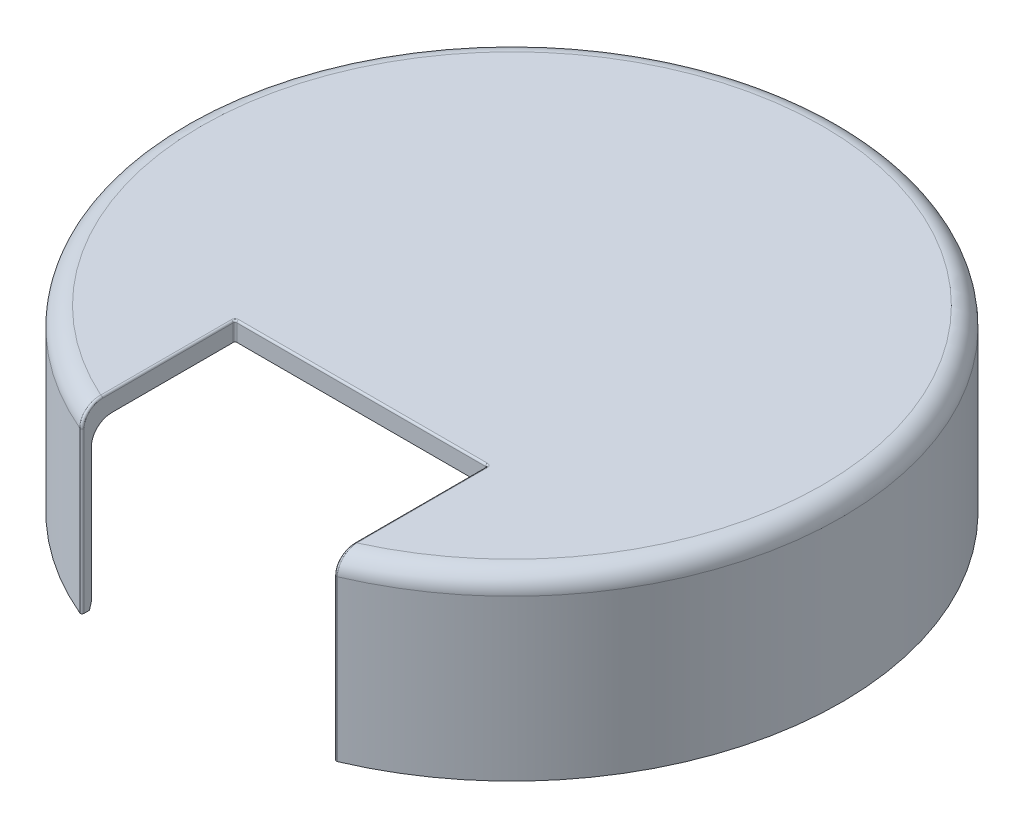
ISO-10303-21;
HEADER;
FILE_DESCRIPTION(('STEP AP214'),'2;1');
FILE_NAME('part.step','',(''),(''),'','','');
FILE_SCHEMA(('AUTOMOTIVE_DESIGN { 1 0 10303 214 1 1 1 1 }'));
ENDSEC;
DATA;
#1=APPLICATION_CONTEXT('core data for automotive mechanical design processes');
#2=APPLICATION_PROTOCOL_DEFINITION('international standard','automotive_design',2000,#1);
#3=PRODUCT_CONTEXT('',#1,'mechanical');
#4=PRODUCT('Part','Part','',(#3));
#5=PRODUCT_RELATED_PRODUCT_CATEGORY('part','',(#4));
#6=PRODUCT_DEFINITION_FORMATION('','',#4);
#7=PRODUCT_DEFINITION_CONTEXT('part definition',#1,'design');
#8=PRODUCT_DEFINITION('design','',#6,#7);
#9=PRODUCT_DEFINITION_SHAPE('','',#8);
#10=(LENGTH_UNIT() NAMED_UNIT(*) SI_UNIT(.MILLI.,.METRE.));
#11=(NAMED_UNIT(*) PLANE_ANGLE_UNIT() SI_UNIT($,.RADIAN.));
#12=(NAMED_UNIT(*) SI_UNIT($,.STERADIAN.) SOLID_ANGLE_UNIT());
#13=UNCERTAINTY_MEASURE_WITH_UNIT(LENGTH_MEASURE(1.E-05),#10,'distance_accuracy_value','');
#14=(GEOMETRIC_REPRESENTATION_CONTEXT(3) GLOBAL_UNCERTAINTY_ASSIGNED_CONTEXT((#13)) GLOBAL_UNIT_ASSIGNED_CONTEXT((#10,
#11,#12)) REPRESENTATION_CONTEXT('',''));
#15=CARTESIAN_POINT('',(0.,0.,0.));
#16=DIRECTION('',(0.,0.,1.));
#17=DIRECTION('',(1.,0.,0.));
#18=AXIS2_PLACEMENT_3D('',#15,#16,#17);
#19=CARTESIAN_POINT('',(0.,8.5,0.));
#20=DIRECTION('',(0.,-1.,0.));
#21=DIRECTION('',(0.,0.,-1.));
#22=AXIS2_PLACEMENT_3D('',#19,#20,#21);
#23=CYLINDRICAL_SURFACE('',#22,17.);
#24=DIRECTION('',(0.,-1.,0.));
#25=VECTOR('',#24,1.);
#26=CARTESIAN_POINT('',(-6.7,8.5,15.6240199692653));
#27=LINE('',#26,#25);
#28=CARTESIAN_POINT('',(-6.7,7.5,15.6240199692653));
#29=VERTEX_POINT('',#28);
#30=CARTESIAN_POINT('',(-6.7,0.373205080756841,15.6240199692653));
#31=VERTEX_POINT('',#30);
#32=EDGE_CURVE('E304',#29,#31,#27,.T.);
#33=ORIENTED_EDGE('',*,*,#32,.T.);
#34=CARTESIAN_POINT('',(0.,0.373205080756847,0.));
#35=DIRECTION('',(0.,1.,0.));
#36=DIRECTION('',(0.,0.,1.));
#37=AXIS2_PLACEMENT_3D('',#34,#35,#36);
#38=CIRCLE('',#37,17.);
#39=CARTESIAN_POINT('',(-16.6285092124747,0.373205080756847,3.53449874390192));
#40=VERTEX_POINT('',#39);
#41=EDGE_CURVE('E238',#31,#40,#38,.F.);
#42=ORIENTED_EDGE('',*,*,#41,.T.);
#43=DIRECTION('',(0.,-1.,0.));
#44=VECTOR('',#43,1.);
#45=CARTESIAN_POINT('',(-16.6285092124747,8.5,3.53449874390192));
#46=LINE('',#45,#44);
#47=CARTESIAN_POINT('',(-16.6285092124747,1.39279404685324,3.53449874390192));
#48=VERTEX_POINT('',#47);
#49=EDGE_CURVE('E525',#48,#40,#46,.T.);
#50=ORIENTED_EDGE('',*,*,#49,.F.);
#51=CARTESIAN_POINT('',(0.,1.39279404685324,0.));
#52=DIRECTION('',(0.,1.,0.));
#53=DIRECTION('',(0.,0.,1.));
#54=AXIS2_PLACEMENT_3D('',#51,#52,#53);
#55=CIRCLE('',#54,17.);
#56=CARTESIAN_POINT('',(-16.6285092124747,1.39279404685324,-3.53449874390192));
#57=VERTEX_POINT('',#56);
#58=EDGE_CURVE('E529',#57,#48,#55,.T.);
#59=ORIENTED_EDGE('',*,*,#58,.F.);
#60=DIRECTION('',(0.,-1.,0.));
#61=VECTOR('',#60,1.);
#62=CARTESIAN_POINT('',(-16.6285092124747,8.5,-3.53449874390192));
#63=LINE('',#62,#61);
#64=CARTESIAN_POINT('',(-16.6285092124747,0.373205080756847,-3.53449874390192));
#65=VERTEX_POINT('',#64);
#66=EDGE_CURVE('E531',#57,#65,#63,.T.);
#67=ORIENTED_EDGE('',*,*,#66,.T.);
#68=CARTESIAN_POINT('',(0.,0.373205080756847,0.));
#69=DIRECTION('',(0.,1.,0.));
#70=DIRECTION('',(0.,0.,1.));
#71=AXIS2_PLACEMENT_3D('',#68,#69,#70);
#72=CIRCLE('',#71,17.);
#73=CARTESIAN_POINT('',(16.6285092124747,0.373205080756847,-3.53449874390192));
#74=VERTEX_POINT('',#73);
#75=EDGE_CURVE('E231',#65,#74,#72,.F.);
#76=ORIENTED_EDGE('',*,*,#75,.T.);
#77=DIRECTION('',(0.,-1.,0.));
#78=VECTOR('',#77,1.);
#79=CARTESIAN_POINT('',(16.6285092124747,8.5,-3.53449874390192));
#80=LINE('',#79,#78);
#81=CARTESIAN_POINT('',(16.6285092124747,1.39279404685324,-3.53449874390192));
#82=VERTEX_POINT('',#81);
#83=EDGE_CURVE('E536',#74,#82,#80,.F.);
#84=ORIENTED_EDGE('',*,*,#83,.T.);
#85=CARTESIAN_POINT('',(0.,1.39279404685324,0.));
#86=DIRECTION('',(0.,1.,0.));
#87=DIRECTION('',(0.,0.,1.));
#88=AXIS2_PLACEMENT_3D('',#85,#86,#87);
#89=CIRCLE('',#88,17.);
#90=CARTESIAN_POINT('',(16.6285092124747,1.39279404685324,3.53449874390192));
#91=VERTEX_POINT('',#90);
#92=EDGE_CURVE('E538',#82,#91,#89,.F.);
#93=ORIENTED_EDGE('',*,*,#92,.T.);
#94=DIRECTION('',(0.,-1.,0.));
#95=VECTOR('',#94,1.);
#96=CARTESIAN_POINT('',(16.6285092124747,8.5,3.53449874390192));
#97=LINE('',#96,#95);
#98=CARTESIAN_POINT('',(16.6285092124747,0.373205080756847,3.53449874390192));
#99=VERTEX_POINT('',#98);
#100=EDGE_CURVE('E541',#99,#91,#97,.F.);
#101=ORIENTED_EDGE('',*,*,#100,.F.);
#102=CARTESIAN_POINT('',(0.,0.373205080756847,0.));
#103=DIRECTION('',(0.,1.,0.));
#104=DIRECTION('',(0.,0.,1.));
#105=AXIS2_PLACEMENT_3D('',#102,#103,#104);
#106=CIRCLE('',#105,17.);
#107=CARTESIAN_POINT('',(6.7,0.373205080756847,15.6240199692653));
#108=VERTEX_POINT('',#107);
#109=EDGE_CURVE('E229',#99,#108,#106,.F.);
#110=ORIENTED_EDGE('',*,*,#109,.T.);
#111=DIRECTION('',(0.,-1.,0.));
#112=VECTOR('',#111,1.);
#113=CARTESIAN_POINT('',(6.7,8.5,15.6240199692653));
#114=LINE('',#113,#112);
#115=CARTESIAN_POINT('',(6.7,7.5,15.6240199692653));
#116=VERTEX_POINT('',#115);
#117=EDGE_CURVE('E286',#108,#116,#114,.F.);
#118=ORIENTED_EDGE('',*,*,#117,.T.);
#119=CARTESIAN_POINT('',(0.,7.5,0.));
#120=DIRECTION('',(0.,-1.,0.));
#121=DIRECTION('',(0.,0.,-1.));
#122=AXIS2_PLACEMENT_3D('',#119,#120,#121);
#123=CIRCLE('',#122,17.);
#124=EDGE_CURVE('E515',#116,#29,#123,.F.);
#125=ORIENTED_EDGE('',*,*,#124,.T.);
#126=EDGE_LOOP('',(#33,#42,#50,#59,#67,#76,#84,#93,#101,#110,#118,#125));
#127=FACE_BOUND('',#126,.T.);
#128=ADVANCED_FACE('F34',(#127),#23,.F.);
#129=CARTESIAN_POINT('',(0.,9.5,0.));
#130=DIRECTION('',(0.,-1.,0.));
#131=DIRECTION('',(0.,0.,-1.));
#132=AXIS2_PLACEMENT_3D('',#129,#130,#131);
#133=CYLINDRICAL_SURFACE('',#132,17.5);
#134=CARTESIAN_POINT('',(0.,8.5,0.));
#135=DIRECTION('',(0.,1.,0.));
#136=DIRECTION('',(0.,0.,1.));
#137=AXIS2_PLACEMENT_3D('',#134,#135,#136);
#138=CIRCLE('',#137,17.5);
#139=CARTESIAN_POINT('',(-6.83908045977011,8.5,16.1082891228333));
#140=VERTEX_POINT('',#139);
#141=CARTESIAN_POINT('',(6.83908045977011,8.5,16.1082891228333));
#142=VERTEX_POINT('',#141);
#143=EDGE_CURVE('E543',#140,#142,#138,.F.);
#144=ORIENTED_EDGE('',*,*,#143,.T.);
#145=DIRECTION('',(0.,-1.,0.));
#146=VECTOR('',#145,1.);
#147=CARTESIAN_POINT('',(6.83908045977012,9.5,16.1082891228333));
#148=LINE('',#147,#146);
#149=CARTESIAN_POINT('',(6.83908045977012,0.,16.1082891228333));
#150=VERTEX_POINT('',#149);
#151=EDGE_CURVE('E61',#142,#150,#148,.T.);
#152=ORIENTED_EDGE('',*,*,#151,.T.);
#153=CARTESIAN_POINT('',(0.,0.,0.));
#154=DIRECTION('',(0.,1.,0.));
#155=DIRECTION('',(0.,0.,1.));
#156=AXIS2_PLACEMENT_3D('',#153,#154,#155);
#157=CIRCLE('',#156,17.5);
#158=CARTESIAN_POINT('',(-6.83908045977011,0.,16.1082891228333));
#159=VERTEX_POINT('',#158);
#160=EDGE_CURVE('E470',#150,#159,#157,.T.);
#161=ORIENTED_EDGE('',*,*,#160,.T.);
#162=DIRECTION('',(0.,-1.,0.));
#163=VECTOR('',#162,1.);
#164=CARTESIAN_POINT('',(-6.83908045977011,9.5,16.1082891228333));
#165=LINE('',#164,#163);
#166=EDGE_CURVE('E585',#159,#140,#165,.F.);
#167=ORIENTED_EDGE('',*,*,#166,.T.);
#168=EDGE_LOOP('',(#144,#152,#161,#167));
#169=FACE_BOUND('',#168,.T.);
#170=ADVANCED_FACE('F295',(#169),#133,.T.);
#171=CARTESIAN_POINT('',(0.,9.5,0.));
#172=DIRECTION('',(0.,1.,0.));
#173=DIRECTION('',(0.,0.,1.));
#174=AXIS2_PLACEMENT_3D('',#171,#172,#173);
#175=PLANE('',#174);
#176=CARTESIAN_POINT('',(6.6,9.5,8.1));
#177=DIRECTION('',(0.,1.,0.));
#178=DIRECTION('',(0.,0.,1.));
#179=AXIS2_PLACEMENT_3D('',#176,#177,#178);
#180=CIRCLE('',#179,0.2);
#181=CARTESIAN_POINT('',(6.6,9.5,7.9));
#182=VERTEX_POINT('',#181);
#183=CARTESIAN_POINT('',(6.8,9.5,8.1));
#184=VERTEX_POINT('',#183);
#185=EDGE_CURVE('E603',#182,#184,#180,.F.);
#186=ORIENTED_EDGE('',*,*,#185,.T.);
#187=DIRECTION('',(0.,0.,-1.));
#188=VECTOR('',#187,1.);
#189=CARTESIAN_POINT('',(6.8,9.5,15.0784614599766));
#190=LINE('',#189,#188);
#191=CARTESIAN_POINT('',(6.8,9.5,15.0336289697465));
#192=VERTEX_POINT('',#191);
#193=EDGE_CURVE('E483',#184,#192,#190,.F.);
#194=ORIENTED_EDGE('',*,*,#193,.T.);
#195=CARTESIAN_POINT('',(0.,9.5,0.));
#196=DIRECTION('',(0.,1.,0.));
#197=DIRECTION('',(0.,0.,1.));
#198=AXIS2_PLACEMENT_3D('',#195,#196,#197);
#199=CIRCLE('',#198,16.5);
#200=CARTESIAN_POINT('',(-6.8,9.5,15.0336289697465));
#201=VERTEX_POINT('',#200);
#202=EDGE_CURVE('E545',#192,#201,#199,.T.);
#203=ORIENTED_EDGE('',*,*,#202,.T.);
#204=DIRECTION('',(0.,0.,1.));
#205=VECTOR('',#204,1.);
#206=CARTESIAN_POINT('',(-6.8,9.5,8.1));
#207=LINE('',#206,#205);
#208=CARTESIAN_POINT('',(-6.8,9.5,8.1));
#209=VERTEX_POINT('',#208);
#210=EDGE_CURVE('E596',#201,#209,#207,.F.);
#211=ORIENTED_EDGE('',*,*,#210,.T.);
#212=CARTESIAN_POINT('',(-6.6,9.5,8.1));
#213=DIRECTION('',(0.,1.,0.));
#214=DIRECTION('',(0.,0.,1.));
#215=AXIS2_PLACEMENT_3D('',#212,#213,#214);
#216=CIRCLE('',#215,0.2);
#217=CARTESIAN_POINT('',(-6.6,9.5,7.9));
#218=VERTEX_POINT('',#217);
#219=EDGE_CURVE('E598',#209,#218,#216,.F.);
#220=ORIENTED_EDGE('',*,*,#219,.T.);
#221=DIRECTION('',(-1.,0.,0.));
#222=VECTOR('',#221,1.);
#223=CARTESIAN_POINT('',(6.6,9.5,7.9));
#224=LINE('',#223,#222);
#225=EDGE_CURVE('E599',#218,#182,#224,.F.);
#226=ORIENTED_EDGE('',*,*,#225,.T.);
#227=EDGE_LOOP('',(#186,#194,#203,#211,#220,#226));
#228=FACE_BOUND('',#227,.T.);
#229=ADVANCED_FACE('F459',(#228),#175,.T.);
#230=CARTESIAN_POINT('',(0.,0.,0.));
#231=DIRECTION('',(0.,1.,0.));
#232=DIRECTION('',(0.,0.,1.));
#233=AXIS2_PLACEMENT_3D('',#230,#231,#232);
#234=PLANE('',#233);
#235=ORIENTED_EDGE('',*,*,#160,.F.);
#236=CARTESIAN_POINT('',(6.8,0.,16.0162417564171));
#237=DIRECTION('',(0.,1.,0.));
#238=DIRECTION('',(0.,0.,1.));
#239=AXIS2_PLACEMENT_3D('',#236,#237,#238);
#240=CIRCLE('',#239,0.1);
#241=CARTESIAN_POINT('',(6.7,0.,16.0162417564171));
#242=VERTEX_POINT('',#241);
#243=EDGE_CURVE('E11',#150,#242,#240,.F.);
#244=ORIENTED_EDGE('',*,*,#243,.T.);
#245=DIRECTION('',(0.,0.,-1.));
#246=VECTOR('',#245,1.);
#247=CARTESIAN_POINT('',(6.7,0.,0.));
#248=LINE('',#247,#246);
#249=CARTESIAN_POINT('',(6.7,0.,15.7327683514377));
#250=VERTEX_POINT('',#249);
#251=EDGE_CURVE('E212',#242,#250,#248,.T.);
#252=ORIENTED_EDGE('',*,*,#251,.T.);
#253=CARTESIAN_POINT('',(0.,0.,0.));
#254=DIRECTION('',(0.,1.,0.));
#255=DIRECTION('',(0.,0.,1.));
#256=AXIS2_PLACEMENT_3D('',#253,#254,#255);
#257=CIRCLE('',#256,17.1);
#258=CARTESIAN_POINT('',(-6.69999999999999,0.,15.7327683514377));
#259=VERTEX_POINT('',#258);
#260=EDGE_CURVE('E249',#250,#259,#257,.T.);
#261=ORIENTED_EDGE('',*,*,#260,.T.);
#262=DIRECTION('',(0.,0.,1.));
#263=VECTOR('',#262,1.);
#264=CARTESIAN_POINT('',(-6.7,0.,0.));
#265=LINE('',#264,#263);
#266=CARTESIAN_POINT('',(-6.69999999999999,0.,16.0162417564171));
#267=VERTEX_POINT('',#266);
#268=EDGE_CURVE('E221',#259,#267,#265,.T.);
#269=ORIENTED_EDGE('',*,*,#268,.T.);
#270=CARTESIAN_POINT('',(-6.8,0.,16.0162417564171));
#271=DIRECTION('',(0.,1.,0.));
#272=DIRECTION('',(0.,0.,1.));
#273=AXIS2_PLACEMENT_3D('',#270,#271,#272);
#274=CIRCLE('',#273,0.1);
#275=EDGE_CURVE('E47',#267,#159,#274,.F.);
#276=ORIENTED_EDGE('',*,*,#275,.T.);
#277=EDGE_LOOP('',(#235,#244,#252,#261,#269,#276));
#278=FACE_BOUND('',#277,.T.);
#279=ADVANCED_FACE('F464',(#278),#234,.F.);
#280=CARTESIAN_POINT('',(0.,8.5,0.));
#281=DIRECTION('',(0.,-1.,0.));
#282=DIRECTION('',(0.,0.,-1.));
#283=AXIS2_PLACEMENT_3D('',#280,#281,#282);
#284=PLANE('',#283);
#285=DIRECTION('',(0.,0.,1.));
#286=VECTOR('',#285,1.);
#287=CARTESIAN_POINT('',(6.7,8.5,0.));
#288=LINE('',#287,#286);
#289=CARTESIAN_POINT('',(6.7,8.5,8.1));
#290=VERTEX_POINT('',#289);
#291=CARTESIAN_POINT('',(6.7,8.5,14.5296249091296));
#292=VERTEX_POINT('',#291);
#293=EDGE_CURVE('E285',#290,#292,#288,.T.);
#294=ORIENTED_EDGE('',*,*,#293,.F.);
#295=CARTESIAN_POINT('',(6.6,8.5,8.1));
#296=DIRECTION('',(0.,-1.,0.));
#297=DIRECTION('',(0.,0.,-1.));
#298=AXIS2_PLACEMENT_3D('',#295,#296,#297);
#299=CIRCLE('',#298,0.0999999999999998);
#300=CARTESIAN_POINT('',(6.6,8.5,8.));
#301=VERTEX_POINT('',#300);
#302=EDGE_CURVE('E233',#301,#290,#299,.T.);
#303=ORIENTED_EDGE('',*,*,#302,.F.);
#304=DIRECTION('',(1.,0.,0.));
#305=VECTOR('',#304,1.);
#306=CARTESIAN_POINT('',(0.,8.5,8.));
#307=LINE('',#306,#305);
#308=CARTESIAN_POINT('',(-6.6,8.5,8.));
#309=VERTEX_POINT('',#308);
#310=EDGE_CURVE('E228',#309,#301,#307,.T.);
#311=ORIENTED_EDGE('',*,*,#310,.F.);
#312=CARTESIAN_POINT('',(-6.6,8.5,8.1));
#313=DIRECTION('',(0.,-1.,0.));
#314=DIRECTION('',(0.,0.,-1.));
#315=AXIS2_PLACEMENT_3D('',#312,#313,#314);
#316=CIRCLE('',#315,0.0999999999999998);
#317=CARTESIAN_POINT('',(-6.7,8.5,8.1));
#318=VERTEX_POINT('',#317);
#319=EDGE_CURVE('E217',#318,#309,#316,.T.);
#320=ORIENTED_EDGE('',*,*,#319,.F.);
#321=DIRECTION('',(0.,0.,-1.));
#322=VECTOR('',#321,1.);
#323=CARTESIAN_POINT('',(-6.7,8.5,0.));
#324=LINE('',#323,#322);
#325=CARTESIAN_POINT('',(-6.7,8.5,14.5296249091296));
#326=VERTEX_POINT('',#325);
#327=EDGE_CURVE('E201',#326,#318,#324,.T.);
#328=ORIENTED_EDGE('',*,*,#327,.F.);
#329=CARTESIAN_POINT('',(0.,8.5,0.));
#330=DIRECTION('',(0.,-1.,0.));
#331=DIRECTION('',(0.,0.,-1.));
#332=AXIS2_PLACEMENT_3D('',#329,#330,#331);
#333=CIRCLE('',#332,16.);
#334=EDGE_CURVE('E473',#326,#292,#333,.T.);
#335=ORIENTED_EDGE('',*,*,#334,.T.);
#336=EDGE_LOOP('',(#294,#303,#311,#320,#328,#335));
#337=FACE_BOUND('',#336,.T.);
#338=ADVANCED_FACE('F226',(#337),#284,.T.);
#339=CARTESIAN_POINT('',(0.,7.5,0.));
#340=DIRECTION('',(0.,-1.,0.));
#341=DIRECTION('',(0.,0.,-1.));
#342=AXIS2_PLACEMENT_3D('',#339,#340,#341);
#343=TOROIDAL_SURFACE('',#342,16.,1.);
#344=ORIENTED_EDGE('',*,*,#124,.F.);
#345=CARTESIAN_POINT('',(6.7,7.92360801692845,13.5256606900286));
#346=CARTESIAN_POINT('',(6.7,7.87811707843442,13.5019218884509));
#347=CARTESIAN_POINT('',(6.7,7.83069760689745,13.4818369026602));
#348=CARTESIAN_POINT('',(6.7,7.7331568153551,13.4498226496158));
#349=CARTESIAN_POINT('',(6.7,7.6830347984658,13.4378954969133));
#350=CARTESIAN_POINT('',(6.7,7.58141205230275,13.4227432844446));
#351=CARTESIAN_POINT('',(6.7,7.52990951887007,13.4195302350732));
#352=CARTESIAN_POINT('',(6.7,7.42712432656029,13.4219990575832));
#353=CARTESIAN_POINT('',(6.7,7.37584164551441,13.4276800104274));
#354=CARTESIAN_POINT('',(6.7,7.27596569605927,13.4474661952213));
#355=CARTESIAN_POINT('',(6.7,7.22733969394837,13.4614075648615));
#356=CARTESIAN_POINT('',(6.7,7.13299336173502,13.496971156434));
#357=CARTESIAN_POINT('',(6.7,7.0872734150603,13.5185943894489));
#358=CARTESIAN_POINT('',(6.7,6.99814189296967,13.5696129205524));
#359=CARTESIAN_POINT('',(6.7,6.95487876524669,13.5992666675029));
#360=CARTESIAN_POINT('',(6.7,6.87343225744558,13.6648661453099));
#361=CARTESIAN_POINT('',(6.7,6.83525051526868,13.700813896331));
#362=CARTESIAN_POINT('',(6.7,6.76146253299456,13.7813034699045));
#363=CARTESIAN_POINT('',(6.7,6.72637792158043,13.8263230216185));
#364=CARTESIAN_POINT('',(6.7,6.66345236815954,13.9211618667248));
#365=CARTESIAN_POINT('',(6.7,6.63561446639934,13.9709831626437));
#366=CARTESIAN_POINT('',(6.7,6.58511497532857,14.0793162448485));
#367=CARTESIAN_POINT('',(6.7,6.56324804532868,14.1381990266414));
#368=CARTESIAN_POINT('',(6.7,6.52896637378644,14.2586576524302));
#369=CARTESIAN_POINT('',(6.7,6.516555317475,14.3202345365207));
#370=CARTESIAN_POINT('',(6.7,6.50082628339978,14.4489949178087));
#371=CARTESIAN_POINT('',(6.7,6.4982166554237,14.5162660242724));
#372=CARTESIAN_POINT('',(6.7,6.50416185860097,14.6503281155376));
#373=CARTESIAN_POINT('',(6.7,6.51271891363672,14.7171190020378));
#374=CARTESIAN_POINT('',(6.7,6.54116357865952,14.849145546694));
#375=CARTESIAN_POINT('',(6.7,6.56119240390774,14.9143510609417));
#376=CARTESIAN_POINT('',(6.7,6.61247515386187,15.0402093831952));
#377=CARTESIAN_POINT('',(6.7,6.6437267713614,15.1008631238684));
#378=CARTESIAN_POINT('',(6.7,6.71508999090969,15.2125123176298));
#379=CARTESIAN_POINT('',(6.7,6.75468278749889,15.2638383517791));
#380=CARTESIAN_POINT('',(6.7,6.84266471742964,15.358312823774));
#381=CARTESIAN_POINT('',(6.7,6.89104858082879,15.4014661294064));
#382=CARTESIAN_POINT('',(6.7,6.99073615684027,15.4743230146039));
#383=CARTESIAN_POINT('',(6.7,7.0414255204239,15.5048669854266));
#384=CARTESIAN_POINT('',(6.7,7.14754967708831,15.5561326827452));
#385=CARTESIAN_POINT('',(6.7,7.20298164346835,15.5768602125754));
#386=CARTESIAN_POINT('',(6.7,7.31213070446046,15.6062513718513));
#387=CARTESIAN_POINT('',(6.7,7.36562195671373,15.61575744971));
#388=CARTESIAN_POINT('',(6.7,7.47343783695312,15.6252252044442));
#389=CARTESIAN_POINT('',(6.7,7.52776220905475,15.6251897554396));
#390=CARTESIAN_POINT('',(6.7,7.63332091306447,15.6157816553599));
#391=CARTESIAN_POINT('',(6.7,7.68459021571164,15.6067946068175));
#392=CARTESIAN_POINT('',(6.7,7.78491419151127,15.5804245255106));
#393=CARTESIAN_POINT('',(6.7,7.83396888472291,15.5630415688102));
#394=CARTESIAN_POINT('',(6.7,7.92909150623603,15.52031990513));
#395=CARTESIAN_POINT('',(6.7,7.9751225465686,15.4948993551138));
#396=CARTESIAN_POINT('',(6.7,8.06255416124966,15.4370726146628));
#397=CARTESIAN_POINT('',(6.7,8.1039538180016,15.4046650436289));
#398=CARTESIAN_POINT('',(6.7,8.18341448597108,15.3319601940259));
#399=CARTESIAN_POINT('',(6.7,8.22116869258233,15.2913281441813));
#400=CARTESIAN_POINT('',(6.7,8.28992621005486,15.2047144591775));
#401=CARTESIAN_POINT('',(6.7,8.3209273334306,15.1587310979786));
#402=CARTESIAN_POINT('',(6.7,8.37793898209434,15.0588053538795));
#403=CARTESIAN_POINT('',(6.7,8.40334881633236,15.0045203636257));
#404=CARTESIAN_POINT('',(6.7,8.44546321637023,14.8926761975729));
#405=CARTESIAN_POINT('',(6.7,8.46216455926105,14.8351158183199));
#406=CARTESIAN_POINT('',(6.7,8.48771021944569,14.713433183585));
#407=CARTESIAN_POINT('',(6.7,8.49581551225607,14.6491552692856));
#408=CARTESIAN_POINT('',(6.7,8.50168533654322,14.5201248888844));
#409=CARTESIAN_POINT('',(6.7,8.49944681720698,14.4553722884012));
#410=CARTESIAN_POINT('',(6.7,8.48434813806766,14.3238261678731));
#411=CARTESIAN_POINT('',(6.7,8.47096351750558,14.257092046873));
#412=CARTESIAN_POINT('',(6.7,8.43309504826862,14.1268060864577));
#413=CARTESIAN_POINT('',(6.7,8.40860672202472,14.0632555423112));
#414=CARTESIAN_POINT('',(6.7,8.3491390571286,13.9418717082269));
#415=CARTESIAN_POINT('',(6.7,8.31424436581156,13.883997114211));
#416=CARTESIAN_POINT('',(6.7,8.2345221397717,13.7756046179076));
#417=CARTESIAN_POINT('',(6.7,8.18971213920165,13.7250739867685));
#418=CARTESIAN_POINT('',(6.7,8.10791590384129,13.6491047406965));
#419=CARTESIAN_POINT('',(6.7,8.07341153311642,13.6209606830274));
#420=CARTESIAN_POINT('',(6.7,8.0009556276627,13.5695187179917));
#421=CARTESIAN_POINT('',(6.7,7.96300504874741,13.5462194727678));
#422=CARTESIAN_POINT('',(6.7,7.92360801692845,13.5256606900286));
#423=B_SPLINE_CURVE_WITH_KNOTS('',3,(#345,#346,#347,#348,#349,#350,#351,#352,#353,#354,#355,
#356,#357,#358,#359,#360,#361,#362,#363,#364,#365,#366,#367,#368,#369,#370,#371,#372,#373,#374,
#375,#376,#377,#378,#379,#380,#381,#382,#383,#384,#385,#386,#387,#388,#389,#390,#391,#392,#393,
#394,#395,#396,#397,#398,#399,#400,#401,#402,#403,#404,#405,#406,#407,#408,#409,#410,#411,#412,
#413,#414,#415,#416,#417,#418,#419,#420,#421,#422),.UNSPECIFIED.,.T.,.F.,(4,2,2,2,2,2,2,2,2,2,2,
2,2,2,2,2,2,2,2,2,2,2,2,2,2,2,2,2,2,2,2,2,2,2,2,2,2,2,4),(0.,0.153789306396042,
0.307618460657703,0.461659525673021,0.615684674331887,0.766752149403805,0.917839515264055,
1.07452898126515,1.23126883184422,1.40179006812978,1.5723827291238,1.76001319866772,
1.947716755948,2.14875032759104,2.34982394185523,2.55342762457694,2.7569894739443,
2.95041270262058,3.14372036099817,3.32031098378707,3.4967970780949,3.65896212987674,
3.82107833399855,3.97650060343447,4.13192146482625,4.28897883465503,4.44606726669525,
4.61175460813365,4.77749554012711,4.95654626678,5.1356632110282,5.32917027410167,
5.52273441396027,5.72595768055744,5.92926296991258,6.13095766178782,6.33229848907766,
6.4655232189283,6.5987111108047),.UNSPECIFIED.);
#424=EDGE_CURVE('E278',#116,#292,#423,.T.);
#425=ORIENTED_EDGE('',*,*,#424,.T.);
#426=ORIENTED_EDGE('',*,*,#334,.F.);
#427=CARTESIAN_POINT('',(-6.7,7.92360801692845,13.5256606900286));
#428=CARTESIAN_POINT('',(-6.7,7.97511721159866,13.5525455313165));
#429=CARTESIAN_POINT('',(-6.7,8.02423525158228,13.5841638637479));
#430=CARTESIAN_POINT('',(-6.7,8.11635779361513,13.6554188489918));
#431=CARTESIAN_POINT('',(-6.7,8.15934656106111,13.695075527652));
#432=CARTESIAN_POINT('',(-6.7,8.23807712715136,13.7806518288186));
#433=CARTESIAN_POINT('',(-6.7,8.27385286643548,13.8265403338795));
#434=CARTESIAN_POINT('',(-6.7,8.33784923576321,13.9232573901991));
#435=CARTESIAN_POINT('',(-6.7,8.36607269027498,13.9740840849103));
#436=CARTESIAN_POINT('',(-6.7,8.41659359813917,14.083585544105));
#437=CARTESIAN_POINT('',(-6.7,8.43823550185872,14.1425628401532));
#438=CARTESIAN_POINT('',(-6.7,8.4720605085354,14.2631809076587));
#439=CARTESIAN_POINT('',(-6.7,8.4842390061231,14.3248229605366));
#440=CARTESIAN_POINT('',(-6.7,8.49947911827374,14.4536978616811));
#441=CARTESIAN_POINT('',(-6.7,8.50182882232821,14.5210159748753));
#442=CARTESIAN_POINT('',(-6.7,8.49535020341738,14.6551270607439));
#443=CARTESIAN_POINT('',(-6.7,8.48651974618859,14.7219199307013));
#444=CARTESIAN_POINT('',(-6.7,8.45752653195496,14.8538474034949));
#445=CARTESIAN_POINT('',(-6.7,8.43723147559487,14.9189531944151));
#446=CARTESIAN_POINT('',(-6.7,8.38543035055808,15.044562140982));
#447=CARTESIAN_POINT('',(-6.7,8.35392669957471,15.1050662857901));
#448=CARTESIAN_POINT('',(-6.7,8.28211808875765,15.2163372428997));
#449=CARTESIAN_POINT('',(-6.7,8.24233730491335,15.2674412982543));
#450=CARTESIAN_POINT('',(-6.7,8.15402165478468,15.361438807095));
#451=CARTESIAN_POINT('',(-6.7,8.10549203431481,15.4043371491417));
#452=CARTESIAN_POINT('',(-6.7,8.00558493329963,15.4766752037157));
#453=CARTESIAN_POINT('',(-6.7,7.95481885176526,15.5069591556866));
#454=CARTESIAN_POINT('',(-6.7,7.84859172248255,15.5576986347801));
#455=CARTESIAN_POINT('',(-6.7,7.79313346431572,15.578159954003));
#456=CARTESIAN_POINT('',(-6.7,7.68396616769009,15.6070518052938));
#457=CARTESIAN_POINT('',(-6.7,7.63047811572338,15.6163211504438));
#458=CARTESIAN_POINT('',(-6.7,7.52271016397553,15.6253259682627));
#459=CARTESIAN_POINT('',(-6.7,7.4684305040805,15.6250642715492));
#460=CARTESIAN_POINT('',(-6.7,7.36296386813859,15.6152301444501));
#461=CARTESIAN_POINT('',(-6.7,7.3117409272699,15.6060370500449));
#462=CARTESIAN_POINT('',(-6.7,7.211541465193,15.5792706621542));
#463=CARTESIAN_POINT('',(-6.7,7.16256492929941,15.5616974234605));
#464=CARTESIAN_POINT('',(-6.7,7.06759745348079,15.5186020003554));
#465=CARTESIAN_POINT('',(-6.7,7.02164581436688,15.492993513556));
#466=CARTESIAN_POINT('',(-6.7,6.93439950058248,15.4348087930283));
#467=CARTESIAN_POINT('',(-6.7,6.89310576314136,15.4022311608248));
#468=CARTESIAN_POINT('',(-6.7,6.8138682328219,15.3291832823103));
#469=CARTESIAN_POINT('',(-6.7,6.77623495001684,15.2883767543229));
#470=CARTESIAN_POINT('',(-6.7,6.7077436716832,15.2014358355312));
#471=CARTESIAN_POINT('',(-6.7,6.67688786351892,15.1552997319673));
#472=CARTESIAN_POINT('',(-6.7,6.6201950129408,15.0550729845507));
#473=CARTESIAN_POINT('',(-6.7,6.59496162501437,15.0006409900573));
#474=CARTESIAN_POINT('',(-6.7,6.55322216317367,14.8885314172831));
#475=CARTESIAN_POINT('',(-6.7,6.5367193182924,14.8308526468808));
#476=CARTESIAN_POINT('',(-6.7,6.51160873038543,14.7089670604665));
#477=CARTESIAN_POINT('',(-6.7,6.50373972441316,14.6446075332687));
#478=CARTESIAN_POINT('',(-6.7,6.49835772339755,14.5154504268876));
#479=CARTESIAN_POINT('',(-6.7,6.50084813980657,14.450652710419));
#480=CARTESIAN_POINT('',(-6.7,6.51647432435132,14.3190849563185));
#481=CARTESIAN_POINT('',(-6.7,6.53013061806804,14.2523759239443));
#482=CARTESIAN_POINT('',(-6.7,6.56853870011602,14.1222077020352));
#483=CARTESIAN_POINT('',(-6.7,6.59329205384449,14.0587489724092));
#484=CARTESIAN_POINT('',(-6.7,6.65324473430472,13.9376780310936));
#485=CARTESIAN_POINT('',(-6.7,6.6883450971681,13.8800170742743));
#486=CARTESIAN_POINT('',(-6.7,6.76846896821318,13.7720290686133));
#487=CARTESIAN_POINT('',(-6.7,6.81348826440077,13.7216989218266));
#488=CARTESIAN_POINT('',(-6.7,6.90866485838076,13.6341056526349));
#489=CARTESIAN_POINT('',(-6.7,6.95817539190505,13.5961418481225));
#490=CARTESIAN_POINT('',(-6.7,7.06348921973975,13.5302764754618));
#491=CARTESIAN_POINT('',(-6.7,7.11928647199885,13.5023653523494));
#492=CARTESIAN_POINT('',(-6.7,7.22901325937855,13.4605842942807));
#493=CARTESIAN_POINT('',(-6.7,7.28248886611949,13.4455196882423));
#494=CARTESIAN_POINT('',(-6.7,7.39130777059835,13.4254238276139));
#495=CARTESIAN_POINT('',(-6.7,7.44665061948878,13.4203901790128));
#496=CARTESIAN_POINT('',(-6.7,7.55303934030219,13.4206184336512));
#497=CARTESIAN_POINT('',(-6.7,7.60408909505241,13.4251200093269));
#498=CARTESIAN_POINT('',(-6.7,7.70463480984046,13.4426832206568));
#499=CARTESIAN_POINT('',(-6.7,7.75413308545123,13.4557313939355));
#500=CARTESIAN_POINT('',(-6.7,7.82300740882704,13.4801094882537));
#501=CARTESIAN_POINT('',(-6.7,7.84357155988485,13.4882298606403));
#502=CARTESIAN_POINT('',(-6.7,7.88407506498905,13.5058922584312));
#503=CARTESIAN_POINT('',(-6.7,7.90401453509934,13.5154340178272));
#504=CARTESIAN_POINT('',(-6.7,7.92360801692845,13.5256606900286));
#505=B_SPLINE_CURVE_WITH_KNOTS('',3,(#427,#428,#429,#430,#431,#432,#433,#434,#435,#436,#437,
#438,#439,#440,#441,#442,#443,#444,#445,#446,#447,#448,#449,#450,#451,#452,#453,#454,#455,#456,
#457,#458,#459,#460,#461,#462,#463,#464,#465,#466,#467,#468,#469,#470,#471,#472,#473,#474,#475,
#476,#477,#478,#479,#480,#481,#482,#483,#484,#485,#486,#487,#488,#489,#490,#491,#492,#493,#494,
#495,#496,#497,#498,#499,#500,#501,#502,#503,#504),.UNSPECIFIED.,.T.,.F.,(4,2,2,2,2,2,2,2,2,2,2,
2,2,2,2,2,2,2,2,2,2,2,2,2,2,2,2,2,2,2,2,2,2,2,2,2,2,2,4),(0.,0.17422007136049,0.348879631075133,
0.522697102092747,0.696449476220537,0.884116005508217,1.07187380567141,1.27301813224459,
1.47420086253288,1.67775407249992,1.88126340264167,2.07450625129,2.26763361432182,
2.4440220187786,2.6203062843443,2.78234051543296,2.94432662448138,3.09972066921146,
3.2551136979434,3.41223640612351,3.56939067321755,3.735215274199,3.90109331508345,
4.08031939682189,4.2596117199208,4.45327313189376,4.64699832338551,4.8503070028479,
5.05364437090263,5.25509675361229,5.45646375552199,5.64259005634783,5.82853897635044,
5.99431758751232,6.16005662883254,6.31307876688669,6.46586044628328,6.53214406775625,
6.59841529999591),.UNSPECIFIED.);
#506=EDGE_CURVE('E207',#326,#29,#505,.T.);
#507=ORIENTED_EDGE('',*,*,#506,.T.);
#508=EDGE_LOOP('',(#344,#425,#426,#507));
#509=FACE_BOUND('',#508,.T.);
#510=ADVANCED_FACE('F289',(#509),#343,.F.);
#511=CARTESIAN_POINT('',(0.,8.5,0.));
#512=DIRECTION('',(0.,1.,0.));
#513=DIRECTION('',(0.,0.,1.));
#514=AXIS2_PLACEMENT_3D('',#511,#512,#513);
#515=TOROIDAL_SURFACE('',#514,16.5,1.);
#516=ORIENTED_EDGE('',*,*,#202,.F.);
#517=CARTESIAN_POINT('',(6.7,9.34013338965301,14.6786579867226));
#518=CARTESIAN_POINT('',(6.7,9.42125307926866,14.6503803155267));
#519=CARTESIAN_POINT('',(6.78492540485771,9.4334815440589,14.6461175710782));
#520=CARTESIAN_POINT('',(6.7,9.35999551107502,14.7355845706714));
#521=CARTESIAN_POINT('',(6.7,9.44504249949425,14.7119361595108));
#522=CARTESIAN_POINT('',(6.78738690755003,9.45555056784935,14.7082287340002));
#523=CARTESIAN_POINT('',(6.7,9.37496116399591,14.7941867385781));
#524=CARTESIAN_POINT('',(6.7,9.46334408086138,14.7748602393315));
#525=CARTESIAN_POINT('',(6.78989800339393,9.47217907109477,14.7721858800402));
#526=CARTESIAN_POINT('',(6.7,9.39496296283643,14.9130691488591));
#527=CARTESIAN_POINT('',(6.7,9.48969542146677,14.9031288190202));
#528=CARTESIAN_POINT('',(6.79494703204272,9.49440329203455,14.9019661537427));
#529=CARTESIAN_POINT('',(6.7,9.3999985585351,14.9733494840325));
#530=CARTESIAN_POINT('',(6.7,9.49751249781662,14.968601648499));
#531=CARTESIAN_POINT('',(6.79748496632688,9.4999983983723,14.9677893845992));
#532=CARTESIAN_POINT('',(6.7,9.40000142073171,15.0930414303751));
#533=CARTESIAN_POINT('',(6.7,9.50251370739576,15.0993413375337));
#534=CARTESIAN_POINT('',(6.80247885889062,9.50000157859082,15.09852155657));
#535=CARTESIAN_POINT('',(6.7,9.39511246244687,15.1524530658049));
#536=CARTESIAN_POINT('',(6.7,9.49958775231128,15.1646726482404));
#537=CARTESIAN_POINT('',(6.80493547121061,9.49456940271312,15.1634300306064));
#538=CARTESIAN_POINT('',(6.7,9.3755413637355,15.2697316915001));
#539=CARTESIAN_POINT('',(6.7,9.48317577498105,15.2946343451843));
#540=CARTESIAN_POINT('',(6.8097434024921,9.47282373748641,15.2915902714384));
#541=CARTESIAN_POINT('',(6.7,9.36084689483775,15.327596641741));
#542=CARTESIAN_POINT('',(6.7,9.46939632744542,15.3592304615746));
#543=CARTESIAN_POINT('',(6.81209458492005,9.45649654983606,15.3548398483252));
#544=CARTESIAN_POINT('',(6.7,9.32174833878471,15.4401037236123));
#545=CARTESIAN_POINT('',(6.7,9.43099887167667,15.486029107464));
#546=CARTESIAN_POINT('',(6.8166292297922,9.41305370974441,15.4778432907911));
#547=CARTESIAN_POINT('',(6.7,9.29732414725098,15.4947389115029));
#548=CARTESIAN_POINT('',(6.7,9.4060835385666,15.5480915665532));
#549=CARTESIAN_POINT('',(6.81881233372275,9.3859157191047,15.5375896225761));
#550=CARTESIAN_POINT('',(6.7,9.23914314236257,15.5987814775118));
#551=CARTESIAN_POINT('',(6.7,9.34535230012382,15.6676291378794));
#552=CARTESIAN_POINT('',(6.82293942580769,9.32127015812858,15.6513873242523));
#553=CARTESIAN_POINT('',(6.7,9.20539278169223,15.6481924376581));
#554=CARTESIAN_POINT('',(6.7,9.30931278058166,15.7248662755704));
#555=CARTESIAN_POINT('',(6.82488357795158,9.28376975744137,15.7054425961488));
#556=CARTESIAN_POINT('',(6.7,9.1313190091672,15.7374042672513));
#557=CARTESIAN_POINT('',(6.7,9.22886666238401,15.8294786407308));
#558=CARTESIAN_POINT('',(6.82837197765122,9.20146556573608,15.8030553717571));
#559=CARTESIAN_POINT('',(6.7,9.09144753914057,15.7775794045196));
#560=CARTESIAN_POINT('',(6.7,9.1848518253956,15.8769789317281));
#561=CARTESIAN_POINT('',(6.82993212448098,9.15716393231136,15.8470214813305));
#562=CARTESIAN_POINT('',(6.7,9.00503852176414,15.8498112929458));
#563=CARTESIAN_POINT('',(6.7,9.08806174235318,15.9634726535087));
#564=CARTESIAN_POINT('',(6.83272394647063,9.06115391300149,15.9260786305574));
#565=CARTESIAN_POINT('',(6.7,8.9585168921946,15.881886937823));
#566=CARTESIAN_POINT('',(6.7,9.03532373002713,16.0021342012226));
#567=CARTESIAN_POINT('',(6.83395638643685,9.00946321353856,15.9611903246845));
#568=CARTESIAN_POINT('',(6.7,8.86437015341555,15.9341818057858));
#569=CARTESIAN_POINT('',(6.7,8.92730349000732,16.0658952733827));
#570=CARTESIAN_POINT('',(6.83595904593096,8.90485572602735,16.0184397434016));
#571=CARTESIAN_POINT('',(6.7,8.81717600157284,15.9551778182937));
#572=CARTESIAN_POINT('',(6.7,8.87269997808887,16.0916234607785));
#573=CARTESIAN_POINT('',(6.83675967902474,8.85241777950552,16.0414273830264));
#574=CARTESIAN_POINT('',(6.7,8.71983761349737,15.9882313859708));
#575=CARTESIAN_POINT('',(6.7,8.75904217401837,16.1325096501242));
#576=CARTESIAN_POINT('',(6.83801788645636,8.74426401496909,16.0776178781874));
#577=CARTESIAN_POINT('',(6.7,8.66970024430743,16.0003089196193));
#578=CARTESIAN_POINT('',(6.7,8.70025389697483,16.1474764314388));
#579=CARTESIAN_POINT('',(6.83847622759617,8.68855582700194,16.0908426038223));
#580=CARTESIAN_POINT('',(6.7,8.57953846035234,16.0133758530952));
#581=CARTESIAN_POINT('',(6.7,8.5939617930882,16.1637629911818));
#582=CARTESIAN_POINT('',(6.83897186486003,8.58837606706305,16.1051508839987));
#583=CARTESIAN_POINT('',(6.7,8.53977525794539,16.0162479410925));
#584=CARTESIAN_POINT('',(6.7,8.54703168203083,16.1673424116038));
#585=CARTESIAN_POINT('',(6.8390806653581,8.544194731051,16.1082959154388));
#586=CARTESIAN_POINT('',(6.7,8.45253002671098,16.0162343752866));
#587=CARTESIAN_POINT('',(6.7,8.44387011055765,16.1673335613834));
#588=CARTESIAN_POINT('',(6.83908021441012,8.44725558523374,16.1082810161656));
#589=CARTESIAN_POINT('',(6.7,8.40504288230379,16.0121273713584));
#590=CARTESIAN_POINT('',(6.7,8.38785885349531,16.1622267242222));
#591=CARTESIAN_POINT('',(6.83892470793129,8.39449209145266,16.103783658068));
#592=CARTESIAN_POINT('',(6.7,8.31120488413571,15.9959043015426));
#593=CARTESIAN_POINT('',(6.7,8.27730330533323,16.1419817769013));
#594=CARTESIAN_POINT('',(6.83830888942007,8.29022764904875,16.086019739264));
#595=CARTESIAN_POINT('',(6.7,8.26486113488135,15.9837471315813));
#596=CARTESIAN_POINT('',(6.7,8.22302942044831,16.1268919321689));
#597=CARTESIAN_POINT('',(6.83784701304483,8.23873459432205,16.072708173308));
#598=CARTESIAN_POINT('',(6.7,8.21992971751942,15.9676828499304));
#599=CARTESIAN_POINT('',(6.7,8.17034913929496,16.1069918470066));
#600=CARTESIAN_POINT('',(6.83723566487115,8.1888107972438,16.0551192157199));
#601=(BOUNDED_SURFACE() B_SPLINE_SURFACE(3,2,((#517,#518,#519),(#520,#521,#522),(#523,#524,
#525),(#526,#527,#528),(#529,#530,#531),(#532,#533,#534),(#535,#536,#537),(#538,#539,#540),
(#541,#542,#543),(#544,#545,#546),(#547,#548,#549),(#550,#551,#552),(#553,#554,#555),(#556,#557,
#558),(#559,#560,#561),(#562,#563,#564),(#565,#566,#567),(#568,#569,#570),(#571,#572,#573),
(#574,#575,#576),(#577,#578,#579),(#580,#581,#582),(#583,#584,#585),(#586,#587,#588),(#589,#590,
#591),(#592,#593,#594),(#595,#596,#597),(#598,#599,#600)),.UNSPECIFIED.,.F.,.F.,
.F.) B_SPLINE_SURFACE_WITH_KNOTS((4,2,2,2,2,2,2,2,2,2,2,2,2,4),(3,3),(0.,0.180619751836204,
0.361249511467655,0.539281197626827,0.717537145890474,0.896163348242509,1.07466626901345,
1.24355483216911,1.412045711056,1.56619538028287,1.71999867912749,1.83921573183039,
1.98149589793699,2.12450820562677),(0.,1.),
.UNSPECIFIED.) GEOMETRIC_REPRESENTATION_ITEM() RATIONAL_B_SPLINE_SURFACE(((1.,0.758533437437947,
1.),(1.,0.750425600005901,1.),(1.,0.742014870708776,1.),(1.,0.724801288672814,1.),(1.,
0.715998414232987,1.),(1.,0.698343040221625,1.),(1.,0.689493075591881,1.),(1.,0.671833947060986,
1.),(1.,0.663024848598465,1.),(1.,0.645700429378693,1.),(1.,0.637185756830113,1.),(1.,
0.620781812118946,1.),(1.,0.61289211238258,1.),(1.,0.598489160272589,1.),(1.,0.591924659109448,
1.),(1.,0.580013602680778,1.),(1.,0.574664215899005,1.),(1.,0.565882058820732,1.),(1.,
0.562324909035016,1.),(1.,0.556703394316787,1.),(1.,0.554635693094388,1.),(1.,0.552396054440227,
1.),(1.,0.551902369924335,1.),(1.,0.551905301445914,1.),(1.,0.552611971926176,1.),(1.,
0.55538803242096,1.),(1.,0.557464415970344,1.),(1.,0.560197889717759,1.))) REPRESENTATION_ITEM('') SURFACE());
#602=CARTESIAN_POINT('',(6.78492540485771,9.4334815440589,14.6461175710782));
#603=CARTESIAN_POINT('',(6.78738690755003,9.45555056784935,14.7082287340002));
#604=CARTESIAN_POINT('',(6.78989800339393,9.47217907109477,14.7721858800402));
#605=CARTESIAN_POINT('',(6.79494703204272,9.49440329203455,14.9019661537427));
#606=CARTESIAN_POINT('',(6.79748496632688,9.4999983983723,14.9677893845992));
#607=CARTESIAN_POINT('',(6.80247885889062,9.50000157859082,15.09852155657));
#608=CARTESIAN_POINT('',(6.80493547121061,9.49456940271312,15.1634300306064));
#609=CARTESIAN_POINT('',(6.8097434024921,9.47282373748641,15.2915902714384));
#610=CARTESIAN_POINT('',(6.81209458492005,9.45649654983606,15.3548398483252));
#611=CARTESIAN_POINT('',(6.8166292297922,9.41305370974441,15.4778432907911));
#612=CARTESIAN_POINT('',(6.81881233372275,9.3859157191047,15.5375896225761));
#613=CARTESIAN_POINT('',(6.82293942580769,9.32127015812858,15.6513873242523));
#614=CARTESIAN_POINT('',(6.82488357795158,9.28376975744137,15.7054425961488));
#615=CARTESIAN_POINT('',(6.82837197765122,9.20146556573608,15.8030553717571));
#616=CARTESIAN_POINT('',(6.82993212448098,9.15716393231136,15.8470214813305));
#617=CARTESIAN_POINT('',(6.83272394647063,9.06115391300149,15.9260786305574));
#618=CARTESIAN_POINT('',(6.83395638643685,9.00946321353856,15.9611903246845));
#619=CARTESIAN_POINT('',(6.83595904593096,8.90485572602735,16.0184397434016));
#620=CARTESIAN_POINT('',(6.83675967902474,8.85241777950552,16.0414273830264));
#621=CARTESIAN_POINT('',(6.83801788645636,8.74426401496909,16.0776178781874));
#622=CARTESIAN_POINT('',(6.83847622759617,8.68855582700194,16.0908426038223));
#623=CARTESIAN_POINT('',(6.83897186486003,8.58837606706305,16.1051508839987));
#624=CARTESIAN_POINT('',(6.8390806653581,8.544194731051,16.1082959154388));
#625=CARTESIAN_POINT('',(6.83908021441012,8.44725558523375,16.1082810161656));
#626=CARTESIAN_POINT('',(6.83892470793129,8.39449209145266,16.103783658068));
#627=CARTESIAN_POINT('',(6.83830888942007,8.29022764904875,16.086019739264));
#628=CARTESIAN_POINT('',(6.83784701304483,8.23873459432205,16.072708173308));
#629=CARTESIAN_POINT('',(6.83723566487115,8.1888107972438,16.0551192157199));
#630=B_SPLINE_CURVE_WITH_KNOTS('',3,(#602,#603,#604,#605,#606,#607,#608,#609,#610,#611,#612,
#613,#614,#615,#616,#617,#618,#619,#620,#621,#622,#623,#624,#625,#626,#627,#628,#629),
.UNSPECIFIED.,.F.,.F.,(4,2,2,2,2,2,2,2,2,2,2,2,2,4),(0.,0.180619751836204,0.361249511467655,
0.539281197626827,0.717537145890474,0.896163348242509,1.07466626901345,1.24355483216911,
1.412045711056,1.56619538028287,1.71999867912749,1.83921573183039,1.98149589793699,
2.12450820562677),.UNSPECIFIED.);
#631=EDGE_CURVE('E384',#192,#142,#630,.T.);
#632=ORIENTED_EDGE('',*,*,#631,.T.);
#633=ORIENTED_EDGE('',*,*,#143,.F.);
#634=CARTESIAN_POINT('',(-6.7,8.21992971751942,15.9676828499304));
#635=CARTESIAN_POINT('',(-6.7,8.17034913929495,16.1069918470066));
#636=CARTESIAN_POINT('',(-6.83723566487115,8.18881079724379,16.0551192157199));
#637=CARTESIAN_POINT('',(-6.7,8.26478558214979,15.9837120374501));
#638=CARTESIAN_POINT('',(-6.7,8.22294145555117,16.1268495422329));
#639=CARTESIAN_POINT('',(-6.83784568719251,8.23865064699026,16.0726697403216));
#640=CARTESIAN_POINT('',(-6.7,8.31102880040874,15.9958546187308));
#641=CARTESIAN_POINT('',(-6.7,8.27709684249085,16.1419205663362));
#642=CARTESIAN_POINT('',(-6.8383070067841,8.29003200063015,16.08596533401));
#643=CARTESIAN_POINT('',(-6.7,8.404848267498,16.0121126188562));
#644=CARTESIAN_POINT('',(-6.7,8.38762906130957,16.1622078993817));
#645=CARTESIAN_POINT('',(-6.83892414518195,8.3942758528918,16.1037675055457));
#646=CARTESIAN_POINT('',(-6.7,8.45242285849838,16.0162376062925));
#647=CARTESIAN_POINT('',(-6.7,8.44374246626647,16.1673364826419));
#648=CARTESIAN_POINT('',(-6.83908032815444,8.44713650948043,16.1082845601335));
#649=CARTESIAN_POINT('',(-6.7,8.54761201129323,16.0162459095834));
#650=CARTESIAN_POINT('',(-6.7,8.55629896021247,16.1673402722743));
#651=CARTESIAN_POINT('',(-6.83908059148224,8.55290223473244,16.1082936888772));
#652=CARTESIAN_POINT('',(-6.7,8.59522657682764,16.0121231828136));
#653=CARTESIAN_POINT('',(-6.7,8.61245307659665,16.1622079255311));
#654=CARTESIAN_POINT('',(-6.83892444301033,8.60580730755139,16.103779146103));
#655=CARTESIAN_POINT('',(-6.7,8.68903428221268,15.995820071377));
#656=CARTESIAN_POINT('',(-6.7,8.72298258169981,16.1418909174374));
#657=CARTESIAN_POINT('',(-6.83830579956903,8.71003809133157,16.0859274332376));
#658=CARTESIAN_POINT('',(-6.7,8.73522780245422,15.9836418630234));
#659=CARTESIAN_POINT('',(-6.69999999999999,8.77709488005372,16.1268093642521));
#660=CARTESIAN_POINT('',(-6.8378433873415,8.76136422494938,16.0725926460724));
#661=CARTESIAN_POINT('',(-6.7,8.8248171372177,15.9517578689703));
#662=CARTESIAN_POINT('',(-6.69999999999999,8.88158997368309,16.0874069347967));
#663=CARTESIAN_POINT('',(-6.83662923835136,8.86090793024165,16.0376830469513));
#664=CARTESIAN_POINT('',(-6.7,8.86821870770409,15.932068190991));
#665=CARTESIAN_POINT('',(-6.7,8.93178251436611,16.0632818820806));
#666=CARTESIAN_POINT('',(-6.83587812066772,8.90913189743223,16.0161258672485));
#667=CARTESIAN_POINT('',(-6.7,8.95129807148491,15.8858723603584));
#668=CARTESIAN_POINT('',(-6.7,9.02715981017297,16.0069227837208));
#669=CARTESIAN_POINT('',(-6.83410899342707,9.00144230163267,15.9655533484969));
#670=CARTESIAN_POINT('',(-6.7,8.99097002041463,15.8593557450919));
#671=CARTESIAN_POINT('',(-6.7,9.07222651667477,15.974890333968));
#672=CARTESIAN_POINT('',(-6.83309057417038,9.04552224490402,15.9365265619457));
#673=CARTESIAN_POINT('',(-6.7,9.0667696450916,15.7995383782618));
#674=CARTESIAN_POINT('',(-6.7,9.15746201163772,15.9030656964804));
#675=CARTESIAN_POINT('',(-6.83078219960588,9.12974405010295,15.8710544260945));
#676=CARTESIAN_POINT('',(-6.7,9.10275495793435,15.7660576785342));
#677=CARTESIAN_POINT('',(-6.7,9.19743735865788,15.8632842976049));
#678=CARTESIAN_POINT('',(-6.82948500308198,9.16972773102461,15.834412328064));
#679=CARTESIAN_POINT('',(-6.7,9.16912391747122,15.6938667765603));
#680=CARTESIAN_POINT('',(-6.7,9.27022170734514,15.7780925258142));
#681=CARTESIAN_POINT('',(-6.82667203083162,9.24347101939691,15.7554162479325));
#682=CARTESIAN_POINT('',(-6.7,9.19949816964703,15.6551479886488));
#683=CARTESIAN_POINT('',(-6.7,9.30307189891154,15.7328802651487));
#684=CARTESIAN_POINT('',(-6.8251558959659,9.27722018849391,15.7130528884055));
#685=CARTESIAN_POINT('',(-6.7,9.25612783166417,15.570567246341));
#686=CARTESIAN_POINT('',(-6.7,9.3632878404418,15.6348818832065));
#687=CARTESIAN_POINT('',(-6.82182281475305,9.34014203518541,15.6205258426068));
#688=CARTESIAN_POINT('',(-6.7,9.28191111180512,15.524388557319));
#689=CARTESIAN_POINT('',(-6.7,9.39024594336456,15.5818971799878));
#690=CARTESIAN_POINT('',(-6.81999190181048,9.36879012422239,15.5700167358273));
#691=CARTESIAN_POINT('',(-6.7,9.32605640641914,15.4285884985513));
#692=CARTESIAN_POINT('',(-6.7,9.43528695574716,15.4728076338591));
#693=CARTESIAN_POINT('',(-6.81616568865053,9.41784045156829,15.4652533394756));
#694=CARTESIAN_POINT('',(-6.7,9.34440631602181,15.3789616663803));
#695=CARTESIAN_POINT('',(-6.7,9.45353485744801,15.4168266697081));
#696=CARTESIAN_POINT('',(-6.8141701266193,9.43822924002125,15.4109931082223));
#697=CARTESIAN_POINT('',(-6.7,9.38621295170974,15.2326606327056));
#698=CARTESIAN_POINT('',(-6.69999999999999,9.4929151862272,15.2545083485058));
#699=CARTESIAN_POINT('',(-6.80824062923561,9.48468105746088,15.2510670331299));
#700=CARTESIAN_POINT('',(-6.7,9.39996936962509,15.1329922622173));
#701=CARTESIAN_POINT('',(-6.69999999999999,9.50420996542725,15.1444288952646));
#702=CARTESIAN_POINT('',(-6.80414537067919,9.49996596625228,15.1421576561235));
#703=CARTESIAN_POINT('',(-6.7,9.4000185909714,14.9733208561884));
#704=CARTESIAN_POINT('',(-6.69999999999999,9.49752884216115,14.9685918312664));
#705=CARTESIAN_POINT('',(-6.79748398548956,9.50002065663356,14.9677579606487));
#706=CARTESIAN_POINT('',(-6.7,9.39498083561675,14.9131251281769));
#707=CARTESIAN_POINT('',(-6.7,9.48971466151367,14.9032004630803));
#708=CARTESIAN_POINT('',(-6.79494951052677,9.4944231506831,14.902027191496));
#709=CARTESIAN_POINT('',(-6.7,9.37497441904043,14.7943158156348));
#710=CARTESIAN_POINT('',(-6.7,9.46336564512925,14.7749866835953));
#711=CARTESIAN_POINT('',(-6.78990338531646,9.47219379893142,14.7723268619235));
#712=CARTESIAN_POINT('',(-6.7,9.35999090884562,14.7357047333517));
#713=CARTESIAN_POINT('',(-6.7,9.44504660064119,14.7120378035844));
#714=CARTESIAN_POINT('',(-6.78739177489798,9.45554545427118,14.7083600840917));
#715=CARTESIAN_POINT('',(-6.7,9.34013338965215,14.6786579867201));
#716=CARTESIAN_POINT('',(-6.7,9.42125307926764,14.650380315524));
#717=CARTESIAN_POINT('',(-6.7849254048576,9.43348154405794,14.6461175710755));
#718=(BOUNDED_SURFACE() B_SPLINE_SURFACE(3,2,((#634,#635,#636),(#637,#638,#639),(#640,#641,
#642),(#643,#644,#645),(#646,#647,#648),(#649,#650,#651),(#652,#653,#654),(#655,#656,#657),
(#658,#659,#660),(#661,#662,#663),(#664,#665,#666),(#667,#668,#669),(#670,#671,#672),(#673,#674,
#675),(#676,#677,#678),(#679,#680,#681),(#682,#683,#684),(#685,#686,#687),(#688,#689,#690),
(#691,#692,#693),(#694,#695,#696),(#697,#698,#699),(#700,#701,#702),(#703,#704,#705),(#706,#707,
#708),(#709,#710,#711),(#712,#713,#714),(#715,#716,#717)),.UNSPECIFIED.,.F.,.F.,
.F.) B_SPLINE_SURFACE_WITH_KNOTS((4,2,2,2,2,2,2,2,2,2,2,2,2,4),(3,3),(0.,0.142731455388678,
0.285292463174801,0.427957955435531,0.570584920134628,0.712907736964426,0.855449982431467,
1.0022764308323,1.1493465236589,1.30731697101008,1.46554364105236,1.76291742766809,
1.94340714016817,2.12416693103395),(0.,1.),
.UNSPECIFIED.) GEOMETRIC_REPRESENTATION_ITEM() RATIONAL_B_SPLINE_SURFACE(((1.,0.560197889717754,
1.),(1.,0.557470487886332,1.),(1.,0.555396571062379,1.),(1.,0.552614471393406,1.),(1.,
0.551904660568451,1.),(1.,0.551902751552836,1.),(1.,0.552611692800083,1.),(1.,0.555403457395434,
1.),(1.,0.557485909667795,1.),(1.,0.562904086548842,1.),(1.,0.566237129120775,1.),(1.,
0.573994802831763,1.),(1.,0.578421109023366,1.),(1.,0.588314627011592,1.),(1.,0.593809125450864,
1.),(1.,0.605536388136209,1.),(1.,0.611770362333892,1.),(1.,0.625247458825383,1.),(1.,
0.632531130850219,1.),(1.,0.647478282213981,1.),(1.,0.655142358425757,1.),(1.,0.677500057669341,
1.),(1.,0.692448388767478,1.),(1.,0.716003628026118,1.),(1.,0.724793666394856,1.),(1.,
0.741995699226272,1.),(1.,0.750407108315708,1.),(1.,0.758533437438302,1.))) REPRESENTATION_ITEM('') SURFACE());
#719=CARTESIAN_POINT('',(-6.83723566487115,8.18881079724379,16.0551192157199));
#720=CARTESIAN_POINT('',(-6.83784568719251,8.23865064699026,16.0726697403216));
#721=CARTESIAN_POINT('',(-6.8383070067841,8.29003200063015,16.08596533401));
#722=CARTESIAN_POINT('',(-6.83892414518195,8.39427585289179,16.1037675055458));
#723=CARTESIAN_POINT('',(-6.83908032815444,8.44713650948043,16.1082845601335));
#724=CARTESIAN_POINT('',(-6.83908059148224,8.55290223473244,16.1082936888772));
#725=CARTESIAN_POINT('',(-6.83892444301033,8.60580730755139,16.103779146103));
#726=CARTESIAN_POINT('',(-6.83830579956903,8.71003809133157,16.0859274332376));
#727=CARTESIAN_POINT('',(-6.8378433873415,8.76136422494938,16.0725926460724));
#728=CARTESIAN_POINT('',(-6.83662923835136,8.86090793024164,16.0376830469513));
#729=CARTESIAN_POINT('',(-6.83587812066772,8.90913189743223,16.0161258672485));
#730=CARTESIAN_POINT('',(-6.83410899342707,9.00144230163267,15.9655533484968));
#731=CARTESIAN_POINT('',(-6.83309057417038,9.04552224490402,15.9365265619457));
#732=CARTESIAN_POINT('',(-6.83078219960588,9.12974405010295,15.8710544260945));
#733=CARTESIAN_POINT('',(-6.82948500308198,9.16972773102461,15.834412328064));
#734=CARTESIAN_POINT('',(-6.82667203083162,9.24347101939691,15.7554162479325));
#735=CARTESIAN_POINT('',(-6.8251558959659,9.27722018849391,15.7130528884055));
#736=CARTESIAN_POINT('',(-6.82182281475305,9.34014203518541,15.6205258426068));
#737=CARTESIAN_POINT('',(-6.81999190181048,9.36879012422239,15.5700167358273));
#738=CARTESIAN_POINT('',(-6.81616568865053,9.41784045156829,15.4652533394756));
#739=CARTESIAN_POINT('',(-6.8141701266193,9.43822924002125,15.4109931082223));
#740=CARTESIAN_POINT('',(-6.8082406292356,9.48468105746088,15.2510670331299));
#741=CARTESIAN_POINT('',(-6.80414537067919,9.49996596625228,15.1421576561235));
#742=CARTESIAN_POINT('',(-6.79748398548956,9.50002065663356,14.9677579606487));
#743=CARTESIAN_POINT('',(-6.79494951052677,9.4944231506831,14.902027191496));
#744=CARTESIAN_POINT('',(-6.78990338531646,9.47219379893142,14.7723268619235));
#745=CARTESIAN_POINT('',(-6.78739177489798,9.45554545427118,14.7083600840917));
#746=CARTESIAN_POINT('',(-6.7849254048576,9.43348154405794,14.6461175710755));
#747=B_SPLINE_CURVE_WITH_KNOTS('',3,(#719,#720,#721,#722,#723,#724,#725,#726,#727,#728,#729,
#730,#731,#732,#733,#734,#735,#736,#737,#738,#739,#740,#741,#742,#743,#744,#745,#746),
.UNSPECIFIED.,.F.,.F.,(4,2,2,2,2,2,2,2,2,2,2,2,2,4),(0.,0.142731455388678,0.285292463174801,
0.427957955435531,0.570584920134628,0.712907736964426,0.855449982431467,1.0022764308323,
1.1493465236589,1.30731697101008,1.46554364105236,1.76291742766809,1.94340714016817,
2.12416693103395),.UNSPECIFIED.);
#748=EDGE_CURVE('E380',#140,#201,#747,.T.);
#749=ORIENTED_EDGE('',*,*,#748,.T.);
#750=EDGE_LOOP('',(#516,#632,#633,#749));
#751=FACE_BOUND('',#750,.T.);
#752=ADVANCED_FACE('F293',(#751),#515,.T.);
#753=CARTESIAN_POINT('',(0.,1.32,0.));
#754=DIRECTION('',(0.,-1.,0.));
#755=DIRECTION('',(0.,0.,-1.));
#756=AXIS2_PLACEMENT_3D('',#753,#754,#755);
#757=CONICAL_SURFACE('',#756,16.8,0.174532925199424);
#758=DIRECTION('',(0.169853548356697,-0.98480775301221,-0.0361034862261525));
#759=VECTOR('',#758,1.);
#760=CARTESIAN_POINT('',(16.4328796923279,1.32,-3.49291640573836));
#761=LINE('',#760,#759);
#762=CARTESIAN_POINT('',(16.4328796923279,1.32,-3.49291640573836));
#763=VERTEX_POINT('',#762);
#764=CARTESIAN_POINT('',(16.5339537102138,0.733974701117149,-3.51440035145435));
#765=VERTEX_POINT('',#764);
#766=EDGE_CURVE('E552',#763,#765,#761,.T.);
#767=ORIENTED_EDGE('',*,*,#766,.T.);
#768=CARTESIAN_POINT('',(16.5339537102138,0.733974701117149,-3.51440035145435));
#769=CARTESIAN_POINT('',(16.5952990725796,0.733974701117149,-3.2258296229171));
#770=CARTESIAN_POINT('',(16.6490749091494,0.733974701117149,-2.93565064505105));
#771=CARTESIAN_POINT('',(16.7413730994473,0.733974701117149,-2.35287677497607));
#772=CARTESIAN_POINT('',(16.7798954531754,0.733974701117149,-2.06028188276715));
#773=CARTESIAN_POINT('',(16.8415722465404,0.733974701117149,-1.47347676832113));
#774=CARTESIAN_POINT('',(16.8647266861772,0.733974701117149,-1.17926654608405));
#775=CARTESIAN_POINT('',(16.8956065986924,0.733974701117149,-0.59003754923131));
#776=CARTESIAN_POINT('',(16.9033320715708,0.733974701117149,-0.295018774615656));
#777=CARTESIAN_POINT('',(16.9033320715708,0.733974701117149,0.295018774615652));
#778=CARTESIAN_POINT('',(16.8956065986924,0.733974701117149,0.590037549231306));
#779=CARTESIAN_POINT('',(16.8647266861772,0.733974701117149,1.17926654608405));
#780=CARTESIAN_POINT('',(16.8415722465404,0.733974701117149,1.47347676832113));
#781=CARTESIAN_POINT('',(16.7798954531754,0.733974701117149,2.06028188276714));
#782=CARTESIAN_POINT('',(16.7413730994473,0.733974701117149,2.35287677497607));
#783=CARTESIAN_POINT('',(16.6490749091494,0.733974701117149,2.93565064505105));
#784=CARTESIAN_POINT('',(16.5952990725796,0.733974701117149,3.22582962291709));
#785=CARTESIAN_POINT('',(16.5339537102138,0.733974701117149,3.51440035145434));
#786=B_SPLINE_CURVE_WITH_KNOTS('',3,(#768,#769,#770,#771,#772,#773,#774,#775,#776,#777,#778,
#779,#780,#781,#782,#783,#784,#785),.UNSPECIFIED.,.F.,.F.,(4,2,2,2,2,2,2,2,4),(0.,
0.884955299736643,1.76991059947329,2.65486589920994,3.53982119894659,4.42477649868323,
5.30973179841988,6.19468709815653,7.07964239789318),.UNSPECIFIED.);
#787=CARTESIAN_POINT('',(16.5339537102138,0.733974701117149,3.51440035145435));
#788=VERTEX_POINT('',#787);
#789=EDGE_CURVE('E365',#765,#788,#786,.T.);
#790=ORIENTED_EDGE('',*,*,#789,.T.);
#791=DIRECTION('',(0.169853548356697,-0.98480775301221,0.0361034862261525));
#792=VECTOR('',#791,1.);
#793=CARTESIAN_POINT('',(16.4328796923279,1.32,3.49291640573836));
#794=LINE('',#793,#792);
#795=CARTESIAN_POINT('',(16.4328796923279,1.32,3.49291640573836));
#796=VERTEX_POINT('',#795);
#797=EDGE_CURVE('E556',#796,#788,#794,.T.);
#798=ORIENTED_EDGE('',*,*,#797,.F.);
#799=CARTESIAN_POINT('',(0.,1.32,0.));
#800=DIRECTION('',(0.,-1.,0.));
#801=DIRECTION('',(0.,0.,-1.));
#802=AXIS2_PLACEMENT_3D('',#799,#800,#801);
#803=CIRCLE('',#802,16.8);
#804=EDGE_CURVE('E474',#763,#796,#803,.T.);
#805=ORIENTED_EDGE('',*,*,#804,.F.);
#806=EDGE_LOOP('',(#767,#790,#798,#805));
#807=FACE_BOUND('',#806,.T.);
#808=ADVANCED_FACE('F665',(#807),#757,.F.);
#809=CARTESIAN_POINT('',(0.,1.55479388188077,0.));
#810=DIRECTION('',(0.,1.,0.));
#811=DIRECTION('',(0.,0.,1.));
#812=AXIS2_PLACEMENT_3D('',#809,#810,#811);
#813=CONICAL_SURFACE('',#812,17.4450908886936,1.22173047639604);
#814=ORIENTED_EDGE('',*,*,#92,.F.);
#815=DIRECTION('',(-0.919158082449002,-0.342020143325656,0.195373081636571));
#816=VECTOR('',#815,1.);
#817=CARTESIAN_POINT('',(17.0638737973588,1.55479388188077,-3.62703834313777));
#818=LINE('',#817,#816);
#819=EDGE_CURVE('E554',#82,#763,#818,.T.);
#820=ORIENTED_EDGE('',*,*,#819,.T.);
#821=ORIENTED_EDGE('',*,*,#804,.T.);
#822=DIRECTION('',(-0.919158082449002,-0.342020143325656,-0.195373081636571));
#823=VECTOR('',#822,1.);
#824=CARTESIAN_POINT('',(17.0638737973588,1.55479388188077,3.62703834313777));
#825=LINE('',#824,#823);
#826=EDGE_CURVE('E558',#91,#796,#825,.T.);
#827=ORIENTED_EDGE('',*,*,#826,.F.);
#828=EDGE_LOOP('',(#814,#820,#821,#827));
#829=FACE_BOUND('',#828,.T.);
#830=ADVANCED_FACE('F658',(#829),#813,.F.);
#831=CARTESIAN_POINT('',(17.0638737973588,0.,-3.62703834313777));
#832=DIRECTION('',(-0.20791169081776,0.,-0.978147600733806));
#833=DIRECTION('',(-0.978147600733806,0.,0.20791169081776));
#834=AXIS2_PLACEMENT_3D('',#831,#832,#833);
#835=PLANE('',#834);
#836=ORIENTED_EDGE('',*,*,#83,.F.);
#837=CARTESIAN_POINT('',(16.6285092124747,0.373205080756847,-3.53449874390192));
#838=CARTESIAN_POINT('',(16.5339537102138,0.73397470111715,-3.51440035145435));
#839=B_SPLINE_CURVE_WITH_KNOTS('',1,(#837,#838),.UNSPECIFIED.,.F.,.F.,(2,2),(0.,1.),.UNSPECIFIED.);
#840=EDGE_CURVE('E805',#74,#765,#839,.T.);
#841=ORIENTED_EDGE('',*,*,#840,.T.);
#842=ORIENTED_EDGE('',*,*,#766,.F.);
#843=ORIENTED_EDGE('',*,*,#819,.F.);
#844=EDGE_LOOP('',(#836,#841,#842,#843));
#845=FACE_BOUND('',#844,.T.);
#846=ADVANCED_FACE('F356',(#845),#835,.T.);
#847=CARTESIAN_POINT('',(17.0638737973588,0.,3.62703834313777));
#848=DIRECTION('',(0.20791169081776,0.,-0.978147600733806));
#849=DIRECTION('',(-0.978147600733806,0.,-0.20791169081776));
#850=AXIS2_PLACEMENT_3D('',#847,#848,#849);
#851=PLANE('',#850);
#852=ORIENTED_EDGE('',*,*,#797,.T.);
#853=CARTESIAN_POINT('',(16.5339537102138,0.733974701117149,3.51440035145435));
#854=CARTESIAN_POINT('',(16.6285092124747,0.373205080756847,3.53449874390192));
#855=B_SPLINE_CURVE_WITH_KNOTS('',1,(#853,#854),.UNSPECIFIED.,.F.,.F.,(2,2),(0.,1.),.UNSPECIFIED.);
#856=EDGE_CURVE('E361',#788,#99,#855,.T.);
#857=ORIENTED_EDGE('',*,*,#856,.T.);
#858=ORIENTED_EDGE('',*,*,#100,.T.);
#859=ORIENTED_EDGE('',*,*,#826,.T.);
#860=EDGE_LOOP('',(#852,#857,#858,#859));
#861=FACE_BOUND('',#860,.T.);
#862=ADVANCED_FACE('F348',(#861),#851,.F.);
#863=CARTESIAN_POINT('',(0.,0.,0.));
#864=DIRECTION('',(0.,-1.,0.));
#865=DIRECTION('',(0.,0.,-1.));
#866=AXIS2_PLACEMENT_3D('',#863,#864,#865);
#867=CONICAL_SURFACE('',#866,17.0327516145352,0.174532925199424);
#868=DIRECTION('',(0.169853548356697,0.98480775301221,-0.0361034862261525));
#869=VECTOR('',#868,1.);
#870=CARTESIAN_POINT('',(-16.4328796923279,1.32,3.49291640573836));
#871=LINE('',#870,#869);
#872=CARTESIAN_POINT('',(-16.5339537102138,0.733974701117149,3.51440035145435));
#873=VERTEX_POINT('',#872);
#874=CARTESIAN_POINT('',(-16.4328796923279,1.32,3.49291640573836));
#875=VERTEX_POINT('',#874);
#876=EDGE_CURVE('E523',#873,#875,#871,.T.);
#877=ORIENTED_EDGE('',*,*,#876,.F.);
#878=CARTESIAN_POINT('',(-16.5339537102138,0.733974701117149,3.51440035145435));
#879=CARTESIAN_POINT('',(-16.5952990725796,0.733974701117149,3.22582962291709));
#880=CARTESIAN_POINT('',(-16.6490749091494,0.733974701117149,2.93565064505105));
#881=CARTESIAN_POINT('',(-16.7413730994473,0.733974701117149,2.35287677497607));
#882=CARTESIAN_POINT('',(-16.7798954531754,0.733974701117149,2.06028188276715));
#883=CARTESIAN_POINT('',(-16.8415722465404,0.733974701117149,1.47347676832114));
#884=CARTESIAN_POINT('',(-16.8647266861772,0.733974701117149,1.17926654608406));
#885=CARTESIAN_POINT('',(-16.8956065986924,0.733974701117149,0.590037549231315));
#886=CARTESIAN_POINT('',(-16.9033320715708,0.733974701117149,0.295018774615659));
#887=CARTESIAN_POINT('',(-16.9033320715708,0.733974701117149,-0.295018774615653));
#888=CARTESIAN_POINT('',(-16.8956065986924,0.733974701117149,-0.590037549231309));
#889=CARTESIAN_POINT('',(-16.8647266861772,0.733974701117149,-1.17926654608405));
#890=CARTESIAN_POINT('',(-16.8415722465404,0.733974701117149,-1.47347676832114));
#891=CARTESIAN_POINT('',(-16.7798954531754,0.733974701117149,-2.06028188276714));
#892=CARTESIAN_POINT('',(-16.7413730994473,0.733974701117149,-2.35287677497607));
#893=CARTESIAN_POINT('',(-16.6490749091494,0.733974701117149,-2.93565064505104));
#894=CARTESIAN_POINT('',(-16.5952990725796,0.733974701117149,-3.22582962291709));
#895=CARTESIAN_POINT('',(-16.5339537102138,0.733974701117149,-3.51440035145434));
#896=B_SPLINE_CURVE_WITH_KNOTS('',3,(#878,#879,#880,#881,#882,#883,#884,#885,#886,#887,#888,
#889,#890,#891,#892,#893,#894,#895),.UNSPECIFIED.,.F.,.F.,(4,2,2,2,2,2,2,2,4),(0.,
0.88495529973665,1.76991059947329,2.65486589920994,3.53982119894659,4.42477649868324,
5.30973179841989,6.19468709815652,7.07964239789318),.UNSPECIFIED.);
#897=CARTESIAN_POINT('',(-16.5339537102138,0.733974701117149,-3.51440035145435));
#898=VERTEX_POINT('',#897);
#899=EDGE_CURVE('E330',#873,#898,#896,.T.);
#900=ORIENTED_EDGE('',*,*,#899,.T.);
#901=DIRECTION('',(0.169853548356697,0.98480775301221,0.0361034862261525));
#902=VECTOR('',#901,1.);
#903=CARTESIAN_POINT('',(-16.4328796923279,1.32,-3.49291640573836));
#904=LINE('',#903,#902);
#905=CARTESIAN_POINT('',(-16.4328796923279,1.32,-3.49291640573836));
#906=VERTEX_POINT('',#905);
#907=EDGE_CURVE('E567',#898,#906,#904,.T.);
#908=ORIENTED_EDGE('',*,*,#907,.T.);
#909=CARTESIAN_POINT('',(0.,1.32,0.));
#910=DIRECTION('',(0.,-1.,0.));
#911=DIRECTION('',(0.,0.,-1.));
#912=AXIS2_PLACEMENT_3D('',#909,#910,#911);
#913=CIRCLE('',#912,16.8);
#914=EDGE_CURVE('E560',#875,#906,#913,.T.);
#915=ORIENTED_EDGE('',*,*,#914,.F.);
#916=EDGE_LOOP('',(#877,#900,#908,#915));
#917=FACE_BOUND('',#916,.T.);
#918=ADVANCED_FACE('F344',(#917),#867,.F.);
#919=CARTESIAN_POINT('',(0.,1.32,0.));
#920=DIRECTION('',(0.,1.,0.));
#921=DIRECTION('',(0.,0.,1.));
#922=AXIS2_PLACEMENT_3D('',#919,#920,#921);
#923=CONICAL_SURFACE('',#922,16.8,1.22173047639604);
#924=DIRECTION('',(-0.919158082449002,0.342020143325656,-0.195373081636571));
#925=VECTOR('',#924,1.);
#926=CARTESIAN_POINT('',(-17.0638737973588,1.55479388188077,-3.62703834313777));
#927=LINE('',#926,#925);
#928=EDGE_CURVE('E565',#906,#57,#927,.T.);
#929=ORIENTED_EDGE('',*,*,#928,.T.);
#930=ORIENTED_EDGE('',*,*,#58,.T.);
#931=DIRECTION('',(-0.919158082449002,0.342020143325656,0.195373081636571));
#932=VECTOR('',#931,1.);
#933=CARTESIAN_POINT('',(-17.0638737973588,1.55479388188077,3.62703834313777));
#934=LINE('',#933,#932);
#935=EDGE_CURVE('E527',#875,#48,#934,.T.);
#936=ORIENTED_EDGE('',*,*,#935,.F.);
#937=ORIENTED_EDGE('',*,*,#914,.T.);
#938=EDGE_LOOP('',(#929,#930,#936,#937));
#939=FACE_BOUND('',#938,.T.);
#940=ADVANCED_FACE('F342',(#939),#923,.F.);
#941=CARTESIAN_POINT('',(-16.6605451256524,0.,3.54130818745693));
#942=DIRECTION('',(-0.20791169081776,0.,-0.978147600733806));
#943=DIRECTION('',(-0.978147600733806,0.,0.20791169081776));
#944=AXIS2_PLACEMENT_3D('',#941,#942,#943);
#945=PLANE('',#944);
#946=ORIENTED_EDGE('',*,*,#935,.T.);
#947=ORIENTED_EDGE('',*,*,#49,.T.);
#948=CARTESIAN_POINT('',(-16.6285092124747,0.373205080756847,3.53449874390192));
#949=CARTESIAN_POINT('',(-16.5339537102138,0.73397470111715,3.51440035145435));
#950=B_SPLINE_CURVE_WITH_KNOTS('',1,(#948,#949),.UNSPECIFIED.,.F.,.F.,(2,2),(0.,1.),.UNSPECIFIED.);
#951=EDGE_CURVE('E326',#40,#873,#950,.T.);
#952=ORIENTED_EDGE('',*,*,#951,.T.);
#953=ORIENTED_EDGE('',*,*,#876,.T.);
#954=EDGE_LOOP('',(#946,#947,#952,#953));
#955=FACE_BOUND('',#954,.T.);
#956=ADVANCED_FACE('F334',(#955),#945,.F.);
#957=CARTESIAN_POINT('',(-16.6605451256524,0.,-3.54130818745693));
#958=DIRECTION('',(0.20791169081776,0.,-0.978147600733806));
#959=DIRECTION('',(-0.978147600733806,0.,-0.20791169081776));
#960=AXIS2_PLACEMENT_3D('',#957,#958,#959);
#961=PLANE('',#960);
#962=ORIENTED_EDGE('',*,*,#66,.F.);
#963=ORIENTED_EDGE('',*,*,#928,.F.);
#964=ORIENTED_EDGE('',*,*,#907,.F.);
#965=CARTESIAN_POINT('',(-16.5339537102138,0.733974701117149,-3.51440035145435));
#966=CARTESIAN_POINT('',(-16.6285092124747,0.373205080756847,-3.53449874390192));
#967=B_SPLINE_CURVE_WITH_KNOTS('',1,(#965,#966),.UNSPECIFIED.,.F.,.F.,(2,2),(0.,1.),.UNSPECIFIED.);
#968=EDGE_CURVE('E807',#898,#65,#967,.T.);
#969=ORIENTED_EDGE('',*,*,#968,.T.);
#970=EDGE_LOOP('',(#962,#963,#964,#969));
#971=FACE_BOUND('',#970,.T.);
#972=ADVANCED_FACE('F260',(#971),#961,.T.);
#973=CARTESIAN_POINT('',(6.7,-1.5,8.1));
#974=DIRECTION('',(1.,0.,0.));
#975=DIRECTION('',(0.,0.,-1.));
#976=AXIS2_PLACEMENT_3D('',#973,#974,#975);
#977=PLANE('',#976);
#978=CARTESIAN_POINT('',(6.7,8.21992971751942,15.9676828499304));
#979=CARTESIAN_POINT('',(6.7,8.26486113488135,15.9837471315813));
#980=CARTESIAN_POINT('',(6.7,8.31120488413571,15.9959043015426));
#981=CARTESIAN_POINT('',(6.7,8.40504288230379,16.0121273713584));
#982=CARTESIAN_POINT('',(6.7,8.45253002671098,16.0162343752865));
#983=CARTESIAN_POINT('',(6.7,8.53977525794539,16.0162479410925));
#984=CARTESIAN_POINT('',(6.7,8.57953846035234,16.0133758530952));
#985=CARTESIAN_POINT('',(6.7,8.66970024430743,16.0003089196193));
#986=CARTESIAN_POINT('',(6.7,8.71983761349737,15.9882313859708));
#987=CARTESIAN_POINT('',(6.7,8.81717600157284,15.9551778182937));
#988=CARTESIAN_POINT('',(6.7,8.86437015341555,15.9341818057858));
#989=CARTESIAN_POINT('',(6.7,8.9585168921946,15.881886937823));
#990=CARTESIAN_POINT('',(6.7,9.00503852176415,15.8498112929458));
#991=CARTESIAN_POINT('',(6.7,9.09144753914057,15.7775794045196));
#992=CARTESIAN_POINT('',(6.7,9.1313190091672,15.7374042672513));
#993=CARTESIAN_POINT('',(6.7,9.20539278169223,15.6481924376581));
#994=CARTESIAN_POINT('',(6.7,9.23914314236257,15.5987814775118));
#995=CARTESIAN_POINT('',(6.7,9.29732414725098,15.4947389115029));
#996=CARTESIAN_POINT('',(6.7,9.32174833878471,15.4401037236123));
#997=CARTESIAN_POINT('',(6.7,9.36084689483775,15.327596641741));
#998=CARTESIAN_POINT('',(6.7,9.3755413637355,15.2697316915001));
#999=CARTESIAN_POINT('',(6.7,9.39511246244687,15.1524530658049));
#1000=CARTESIAN_POINT('',(6.7,9.40000142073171,15.0930414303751));
#1001=CARTESIAN_POINT('',(6.7,9.3999985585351,14.9733494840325));
#1002=CARTESIAN_POINT('',(6.7,9.39496296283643,14.9130691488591));
#1003=CARTESIAN_POINT('',(6.7,9.37496116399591,14.7941867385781));
#1004=CARTESIAN_POINT('',(6.7,9.35999551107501,14.7355845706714));
#1005=CARTESIAN_POINT('',(6.7,9.34013338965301,14.6786579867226));
#1006=B_SPLINE_CURVE_WITH_KNOTS('',3,(#978,#979,#980,#981,#982,#983,#984,#985,#986,#987,#988,
#989,#990,#991,#992,#993,#994,#995,#996,#997,#998,#999,#1000,#1001,#1002,#1003,#1004,#1005),
.UNSPECIFIED.,.F.,.F.,(4,2,2,2,2,2,2,2,2,2,2,2,2,4),(0.,0.143012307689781,0.28529247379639,
0.40450952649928,0.558312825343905,0.712462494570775,0.880953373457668,1.04984193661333,
1.22834485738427,1.4069710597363,1.58522700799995,1.76325869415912,1.94388845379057,
2.12450820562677),.UNSPECIFIED.);
#1007=CARTESIAN_POINT('',(6.7,8.5,16.0162417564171));
#1008=VERTEX_POINT('',#1007);
#1009=CARTESIAN_POINT('',(6.7,9.4,15.0336289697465));
#1010=VERTEX_POINT('',#1009);
#1011=EDGE_CURVE('E269',#1008,#1010,#1006,.T.);
#1012=ORIENTED_EDGE('',*,*,#1011,.T.);
#1013=DIRECTION('',(0.,0.,-1.));
#1014=VECTOR('',#1013,1.);
#1015=CARTESIAN_POINT('',(6.7,9.4,8.1));
#1016=LINE('',#1015,#1014);
#1017=CARTESIAN_POINT('',(6.7,9.4,8.1));
#1018=VERTEX_POINT('',#1017);
#1019=EDGE_CURVE('E378',#1010,#1018,#1016,.T.);
#1020=ORIENTED_EDGE('',*,*,#1019,.T.);
#1021=DIRECTION('',(0.,1.,0.));
#1022=VECTOR('',#1021,1.);
#1023=CARTESIAN_POINT('',(6.7,-1.5,8.1));
#1024=LINE('',#1023,#1022);
#1025=EDGE_CURVE('E499',#290,#1018,#1024,.T.);
#1026=ORIENTED_EDGE('',*,*,#1025,.F.);
#1027=ORIENTED_EDGE('',*,*,#293,.T.);
#1028=ORIENTED_EDGE('',*,*,#424,.F.);
#1029=ORIENTED_EDGE('',*,*,#117,.F.);
#1030=CARTESIAN_POINT('',(6.7,0.373205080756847,15.6240199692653));
#1031=CARTESIAN_POINT('',(6.7,0.311006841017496,15.642153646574));
#1032=CARTESIAN_POINT('',(6.7,0.248807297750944,15.6602828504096));
#1033=CARTESIAN_POINT('',(6.7,0.124405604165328,15.6965323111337));
#1034=CARTESIAN_POINT('',(6.7,0.0622034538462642,15.7146525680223));
#1035=CARTESIAN_POINT('',(6.7,0.,15.7327683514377));
#1036=B_SPLINE_CURVE_WITH_KNOTS('',3,(#1030,#1031,#1032,#1033,#1034,#1035),.UNSPECIFIED.,.F.,
.F.,(4,2,4),(0.,0.194363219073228,0.388726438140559),.UNSPECIFIED.);
#1037=EDGE_CURVE('E241',#108,#250,#1036,.T.);
#1038=ORIENTED_EDGE('',*,*,#1037,.T.);
#1039=ORIENTED_EDGE('',*,*,#251,.F.);
#1040=DIRECTION('',(0.,-1.,0.));
#1041=VECTOR('',#1040,1.);
#1042=CARTESIAN_POINT('',(6.7,-1.5,16.0162417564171));
#1043=LINE('',#1042,#1041);
#1044=EDGE_CURVE('E364',#242,#1008,#1043,.F.);
#1045=ORIENTED_EDGE('',*,*,#1044,.T.);
#1046=EDGE_LOOP('',(#1012,#1020,#1026,#1027,#1028,#1029,#1038,#1039,#1045));
#1047=FACE_BOUND('',#1046,.T.);
#1048=ADVANCED_FACE('F255',(#1047),#977,.F.);
#1049=CARTESIAN_POINT('',(-6.7,-1.5,8.1));
#1050=DIRECTION('',(-1.,0.,0.));
#1051=DIRECTION('',(0.,0.,1.));
#1052=AXIS2_PLACEMENT_3D('',#1049,#1050,#1051);
#1053=PLANE('',#1052);
#1054=DIRECTION('',(0.,1.,0.));
#1055=VECTOR('',#1054,1.);
#1056=CARTESIAN_POINT('',(-6.7,-1.5,8.1));
#1057=LINE('',#1056,#1055);
#1058=CARTESIAN_POINT('',(-6.7,9.4,8.1));
#1059=VERTEX_POINT('',#1058);
#1060=EDGE_CURVE('E204',#318,#1059,#1057,.T.);
#1061=ORIENTED_EDGE('',*,*,#1060,.T.);
#1062=DIRECTION('',(0.,0.,1.));
#1063=VECTOR('',#1062,1.);
#1064=CARTESIAN_POINT('',(-6.7,9.4,15.0784614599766));
#1065=LINE('',#1064,#1063);
#1066=CARTESIAN_POINT('',(-6.7,9.4,15.0336289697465));
#1067=VERTEX_POINT('',#1066);
#1068=EDGE_CURVE('E584',#1059,#1067,#1065,.T.);
#1069=ORIENTED_EDGE('',*,*,#1068,.T.);
#1070=CARTESIAN_POINT('',(-6.7,9.34013338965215,14.6786579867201));
#1071=CARTESIAN_POINT('',(-6.7,9.35999090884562,14.7357047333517));
#1072=CARTESIAN_POINT('',(-6.7,9.37497441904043,14.7943158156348));
#1073=CARTESIAN_POINT('',(-6.7,9.39498083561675,14.9131251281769));
#1074=CARTESIAN_POINT('',(-6.7,9.4000185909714,14.9733208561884));
#1075=CARTESIAN_POINT('',(-6.7,9.39996936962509,15.1329922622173));
#1076=CARTESIAN_POINT('',(-6.7,9.38621295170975,15.2326606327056));
#1077=CARTESIAN_POINT('',(-6.7,9.34440631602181,15.3789616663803));
#1078=CARTESIAN_POINT('',(-6.7,9.32605640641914,15.4285884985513));
#1079=CARTESIAN_POINT('',(-6.7,9.28191111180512,15.524388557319));
#1080=CARTESIAN_POINT('',(-6.7,9.25612783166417,15.570567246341));
#1081=CARTESIAN_POINT('',(-6.7,9.19949816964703,15.6551479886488));
#1082=CARTESIAN_POINT('',(-6.7,9.16912391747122,15.6938667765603));
#1083=CARTESIAN_POINT('',(-6.7,9.10275495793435,15.7660576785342));
#1084=CARTESIAN_POINT('',(-6.7,9.0667696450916,15.7995383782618));
#1085=CARTESIAN_POINT('',(-6.7,8.99097002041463,15.8593557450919));
#1086=CARTESIAN_POINT('',(-6.7,8.95129807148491,15.8858723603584));
#1087=CARTESIAN_POINT('',(-6.7,8.86821870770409,15.932068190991));
#1088=CARTESIAN_POINT('',(-6.7,8.8248171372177,15.9517578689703));
#1089=CARTESIAN_POINT('',(-6.7,8.73522780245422,15.9836418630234));
#1090=CARTESIAN_POINT('',(-6.7,8.68903428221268,15.995820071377));
#1091=CARTESIAN_POINT('',(-6.7,8.59522657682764,16.0121231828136));
#1092=CARTESIAN_POINT('',(-6.7,8.54761201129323,16.0162459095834));
#1093=CARTESIAN_POINT('',(-6.7,8.45242285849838,16.0162376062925));
#1094=CARTESIAN_POINT('',(-6.7,8.404848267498,16.0121126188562));
#1095=CARTESIAN_POINT('',(-6.7,8.31102880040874,15.9958546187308));
#1096=CARTESIAN_POINT('',(-6.7,8.26478558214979,15.9837120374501));
#1097=CARTESIAN_POINT('',(-6.7,8.21992971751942,15.9676828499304));
#1098=B_SPLINE_CURVE_WITH_KNOTS('',3,(#1070,#1071,#1072,#1073,#1074,#1075,#1076,#1077,#1078,
#1079,#1080,#1081,#1082,#1083,#1084,#1085,#1086,#1087,#1088,#1089,#1090,#1091,#1092,#1093,#1094,
#1095,#1096,#1097),.UNSPECIFIED.,.F.,.F.,(4,2,2,2,2,2,2,2,2,2,2,2,2,4),(0.,0.180759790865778,
0.361249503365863,0.658623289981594,0.816849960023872,0.974820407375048,1.12189050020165,
1.26871694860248,1.41125919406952,1.55358201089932,1.69620897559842,1.83887446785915,
1.98143547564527,2.12416693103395),.UNSPECIFIED.);
#1099=CARTESIAN_POINT('',(-6.7,8.5,16.0162417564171));
#1100=VERTEX_POINT('',#1099);
#1101=EDGE_CURVE('E312',#1067,#1100,#1098,.T.);
#1102=ORIENTED_EDGE('',*,*,#1101,.T.);
#1103=DIRECTION('',(0.,-1.,0.));
#1104=VECTOR('',#1103,1.);
#1105=CARTESIAN_POINT('',(-6.7,-1.5,16.0162417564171));
#1106=LINE('',#1105,#1104);
#1107=EDGE_CURVE('E579',#1100,#267,#1106,.T.);
#1108=ORIENTED_EDGE('',*,*,#1107,.T.);
#1109=ORIENTED_EDGE('',*,*,#268,.F.);
#1110=CARTESIAN_POINT('',(-6.69999999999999,0.,15.7327683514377));
#1111=CARTESIAN_POINT('',(-6.69999999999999,0.0622034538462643,15.7146525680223));
#1112=CARTESIAN_POINT('',(-6.7,0.124405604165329,15.6965323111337));
#1113=CARTESIAN_POINT('',(-6.7,0.248807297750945,15.6602828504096));
#1114=CARTESIAN_POINT('',(-6.7,0.311006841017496,15.642153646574));
#1115=CARTESIAN_POINT('',(-6.7,0.373205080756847,15.6240199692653));
#1116=B_SPLINE_CURVE_WITH_KNOTS('',3,(#1110,#1111,#1112,#1113,#1114,#1115),.UNSPECIFIED.,.F.,
.F.,(4,2,4),(0.,0.194363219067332,0.388726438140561),.UNSPECIFIED.);
#1117=EDGE_CURVE('E321',#259,#31,#1116,.T.);
#1118=ORIENTED_EDGE('',*,*,#1117,.T.);
#1119=ORIENTED_EDGE('',*,*,#32,.F.);
#1120=ORIENTED_EDGE('',*,*,#506,.F.);
#1121=ORIENTED_EDGE('',*,*,#327,.T.);
#1122=EDGE_LOOP('',(#1061,#1069,#1102,#1108,#1109,#1118,#1119,#1120,#1121));
#1123=FACE_BOUND('',#1122,.T.);
#1124=ADVANCED_FACE('F203',(#1123),#1053,.F.);
#1125=CARTESIAN_POINT('',(-6.6,-1.5,8.1));
#1126=DIRECTION('',(0.,1.,0.));
#1127=DIRECTION('',(0.,0.,1.));
#1128=AXIS2_PLACEMENT_3D('',#1125,#1126,#1127);
#1129=CYLINDRICAL_SURFACE('',#1128,0.0999999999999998);
#1130=DIRECTION('',(0.,1.,0.));
#1131=VECTOR('',#1130,1.);
#1132=CARTESIAN_POINT('',(-6.6,-1.5,8.));
#1133=LINE('',#1132,#1131);
#1134=CARTESIAN_POINT('',(-6.6,9.4,8.));
#1135=VERTEX_POINT('',#1134);
#1136=EDGE_CURVE('E222',#309,#1135,#1133,.T.);
#1137=ORIENTED_EDGE('',*,*,#1136,.T.);
#1138=CARTESIAN_POINT('',(-6.6,9.4,8.1));
#1139=DIRECTION('',(0.,1.,0.));
#1140=DIRECTION('',(0.,0.,1.));
#1141=AXIS2_PLACEMENT_3D('',#1138,#1139,#1140);
#1142=CIRCLE('',#1141,0.0999999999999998);
#1143=EDGE_CURVE('E220',#1135,#1059,#1142,.T.);
#1144=ORIENTED_EDGE('',*,*,#1143,.T.);
#1145=ORIENTED_EDGE('',*,*,#1060,.F.);
#1146=ORIENTED_EDGE('',*,*,#319,.T.);
#1147=EDGE_LOOP('',(#1137,#1144,#1145,#1146));
#1148=FACE_BOUND('',#1147,.T.);
#1149=ADVANCED_FACE('F216',(#1148),#1129,.F.);
#1150=CARTESIAN_POINT('',(-6.6,-1.5,8.));
#1151=DIRECTION('',(0.,0.,-1.));
#1152=DIRECTION('',(-1.,0.,0.));
#1153=AXIS2_PLACEMENT_3D('',#1150,#1151,#1152);
#1154=PLANE('',#1153);
#1155=DIRECTION('',(0.,1.,0.));
#1156=VECTOR('',#1155,1.);
#1157=CARTESIAN_POINT('',(6.6,-1.5,8.));
#1158=LINE('',#1157,#1156);
#1159=CARTESIAN_POINT('',(6.6,9.4,8.));
#1160=VERTEX_POINT('',#1159);
#1161=EDGE_CURVE('E503',#301,#1160,#1158,.T.);
#1162=ORIENTED_EDGE('',*,*,#1161,.T.);
#1163=DIRECTION('',(-1.,0.,0.));
#1164=VECTOR('',#1163,1.);
#1165=CARTESIAN_POINT('',(-6.6,9.4,8.));
#1166=LINE('',#1165,#1164);
#1167=EDGE_CURVE('E575',#1160,#1135,#1166,.T.);
#1168=ORIENTED_EDGE('',*,*,#1167,.T.);
#1169=ORIENTED_EDGE('',*,*,#1136,.F.);
#1170=ORIENTED_EDGE('',*,*,#310,.T.);
#1171=EDGE_LOOP('',(#1162,#1168,#1169,#1170));
#1172=FACE_BOUND('',#1171,.T.);
#1173=ADVANCED_FACE('F574',(#1172),#1154,.F.);
#1174=CARTESIAN_POINT('',(6.6,-1.5,8.1));
#1175=DIRECTION('',(0.,1.,0.));
#1176=DIRECTION('',(0.,0.,1.));
#1177=AXIS2_PLACEMENT_3D('',#1174,#1175,#1176);
#1178=CYLINDRICAL_SURFACE('',#1177,0.0999999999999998);
#1179=ORIENTED_EDGE('',*,*,#1025,.T.);
#1180=CARTESIAN_POINT('',(6.6,9.4,8.1));
#1181=DIRECTION('',(0.,1.,0.));
#1182=DIRECTION('',(0.,0.,1.));
#1183=AXIS2_PLACEMENT_3D('',#1180,#1181,#1182);
#1184=CIRCLE('',#1183,0.0999999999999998);
#1185=EDGE_CURVE('E571',#1018,#1160,#1184,.T.);
#1186=ORIENTED_EDGE('',*,*,#1185,.T.);
#1187=ORIENTED_EDGE('',*,*,#1161,.F.);
#1188=ORIENTED_EDGE('',*,*,#302,.T.);
#1189=EDGE_LOOP('',(#1179,#1186,#1187,#1188));
#1190=FACE_BOUND('',#1189,.T.);
#1191=ADVANCED_FACE('F262',(#1190),#1178,.F.);
#1192=CARTESIAN_POINT('',(0.,0.373205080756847,0.));
#1193=DIRECTION('',(0.,-1.,0.));
#1194=DIRECTION('',(0.,0.,-1.));
#1195=AXIS2_PLACEMENT_3D('',#1192,#1193,#1194);
#1196=CONICAL_SURFACE('',#1195,17.,0.261799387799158);
#1197=ORIENTED_EDGE('',*,*,#1117,.F.);
#1198=ORIENTED_EDGE('',*,*,#260,.F.);
#1199=ORIENTED_EDGE('',*,*,#1037,.F.);
#1200=ORIENTED_EDGE('',*,*,#109,.F.);
#1201=ORIENTED_EDGE('',*,*,#856,.F.);
#1202=ORIENTED_EDGE('',*,*,#789,.F.);
#1203=ORIENTED_EDGE('',*,*,#840,.F.);
#1204=ORIENTED_EDGE('',*,*,#75,.F.);
#1205=ORIENTED_EDGE('',*,*,#968,.F.);
#1206=ORIENTED_EDGE('',*,*,#899,.F.);
#1207=ORIENTED_EDGE('',*,*,#951,.F.);
#1208=ORIENTED_EDGE('',*,*,#41,.F.);
#1209=EDGE_LOOP('',(#1197,#1198,#1199,#1200,#1201,#1202,#1203,#1204,#1205,#1206,#1207,#1208));
#1210=FACE_BOUND('',#1209,.T.);
#1211=ADVANCED_FACE('F251',(#1210),#1196,.F.);
#1212=CARTESIAN_POINT('',(-6.8,9.5,16.0162417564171));
#1213=DIRECTION('',(0.,-1.,0.));
#1214=DIRECTION('',(0.,0.,-1.));
#1215=AXIS2_PLACEMENT_3D('',#1212,#1213,#1214);
#1216=CYLINDRICAL_SURFACE('',#1215,0.1);
#1217=ORIENTED_EDGE('',*,*,#275,.F.);
#1218=ORIENTED_EDGE('',*,*,#1107,.F.);
#1219=CARTESIAN_POINT('',(-6.8,8.5,16.0162417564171));
#1220=DIRECTION('',(0.,1.,0.));
#1221=DIRECTION('',(0.,0.,1.));
#1222=AXIS2_PLACEMENT_3D('',#1219,#1220,#1221);
#1223=CIRCLE('',#1222,0.1);
#1224=EDGE_CURVE('E497',#140,#1100,#1223,.T.);
#1225=ORIENTED_EDGE('',*,*,#1224,.F.);
#1226=ORIENTED_EDGE('',*,*,#166,.F.);
#1227=EDGE_LOOP('',(#1217,#1218,#1225,#1226));
#1228=FACE_BOUND('',#1227,.T.);
#1229=ADVANCED_FACE('F36',(#1228),#1216,.T.);
#1230=ORIENTED_EDGE('',*,*,#1224,.T.);
#1231=ORIENTED_EDGE('',*,*,#1101,.F.);
#1232=CARTESIAN_POINT('',(-6.8,9.4,15.0336289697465));
#1233=DIRECTION('',(0.,0.,-1.));
#1234=DIRECTION('',(-1.,0.,0.));
#1235=AXIS2_PLACEMENT_3D('',#1232,#1233,#1234);
#1236=CIRCLE('',#1235,0.1);
#1237=EDGE_CURVE('E495',#201,#1067,#1236,.T.);
#1238=ORIENTED_EDGE('',*,*,#1237,.F.);
#1239=ORIENTED_EDGE('',*,*,#748,.F.);
#1240=EDGE_LOOP('',(#1230,#1231,#1238,#1239));
#1241=FACE_BOUND('',#1240,.T.);
#1242=ADVANCED_FACE('F399',(#1241),#718,.T.);
#1243=CARTESIAN_POINT('',(-6.8,9.4,8.1));
#1244=DIRECTION('',(0.,0.,-1.));
#1245=DIRECTION('',(-1.,0.,0.));
#1246=AXIS2_PLACEMENT_3D('',#1243,#1244,#1245);
#1247=CYLINDRICAL_SURFACE('',#1246,0.1);
#1248=ORIENTED_EDGE('',*,*,#1237,.T.);
#1249=ORIENTED_EDGE('',*,*,#1068,.F.);
#1250=CARTESIAN_POINT('',(-6.8,9.4,8.1));
#1251=DIRECTION('',(0.,0.,-1.));
#1252=DIRECTION('',(-1.,0.,0.));
#1253=AXIS2_PLACEMENT_3D('',#1250,#1251,#1252);
#1254=CIRCLE('',#1253,0.1);
#1255=EDGE_CURVE('E491',#209,#1059,#1254,.T.);
#1256=ORIENTED_EDGE('',*,*,#1255,.F.);
#1257=ORIENTED_EDGE('',*,*,#210,.F.);
#1258=EDGE_LOOP('',(#1248,#1249,#1256,#1257));
#1259=FACE_BOUND('',#1258,.T.);
#1260=ADVANCED_FACE('F403',(#1259),#1247,.T.);
#1261=CARTESIAN_POINT('',(-6.6,9.4,8.1));
#1262=DIRECTION('',(0.,1.,0.));
#1263=DIRECTION('',(0.,0.,1.));
#1264=AXIS2_PLACEMENT_3D('',#1261,#1262,#1263);
#1265=TOROIDAL_SURFACE('',#1264,0.2,0.1);
#1266=ORIENTED_EDGE('',*,*,#1255,.T.);
#1267=ORIENTED_EDGE('',*,*,#1143,.F.);
#1268=CARTESIAN_POINT('',(-6.6,9.4,7.9));
#1269=DIRECTION('',(1.,0.,0.));
#1270=DIRECTION('',(0.,0.,-1.));
#1271=AXIS2_PLACEMENT_3D('',#1268,#1269,#1270);
#1272=CIRCLE('',#1271,0.1);
#1273=EDGE_CURVE('E488',#218,#1135,#1272,.T.);
#1274=ORIENTED_EDGE('',*,*,#1273,.F.);
#1275=ORIENTED_EDGE('',*,*,#219,.F.);
#1276=EDGE_LOOP('',(#1266,#1267,#1274,#1275));
#1277=FACE_BOUND('',#1276,.T.);
#1278=ADVANCED_FACE('F444',(#1277),#1265,.T.);
#1279=CARTESIAN_POINT('',(-6.6,9.4,7.9));
#1280=DIRECTION('',(1.,0.,0.));
#1281=DIRECTION('',(0.,0.,-1.));
#1282=AXIS2_PLACEMENT_3D('',#1279,#1280,#1281);
#1283=CYLINDRICAL_SURFACE('',#1282,0.1);
#1284=ORIENTED_EDGE('',*,*,#1273,.T.);
#1285=ORIENTED_EDGE('',*,*,#1167,.F.);
#1286=CARTESIAN_POINT('',(6.6,9.4,7.9));
#1287=DIRECTION('',(1.,0.,0.));
#1288=DIRECTION('',(0.,0.,-1.));
#1289=AXIS2_PLACEMENT_3D('',#1286,#1287,#1288);
#1290=CIRCLE('',#1289,0.1);
#1291=EDGE_CURVE('E486',#182,#1160,#1290,.T.);
#1292=ORIENTED_EDGE('',*,*,#1291,.F.);
#1293=ORIENTED_EDGE('',*,*,#225,.F.);
#1294=EDGE_LOOP('',(#1284,#1285,#1292,#1293));
#1295=FACE_BOUND('',#1294,.T.);
#1296=ADVANCED_FACE('F441',(#1295),#1283,.T.);
#1297=CARTESIAN_POINT('',(6.6,9.4,8.1));
#1298=DIRECTION('',(0.,1.,0.));
#1299=DIRECTION('',(0.,0.,1.));
#1300=AXIS2_PLACEMENT_3D('',#1297,#1298,#1299);
#1301=TOROIDAL_SURFACE('',#1300,0.2,0.1);
#1302=ORIENTED_EDGE('',*,*,#1291,.T.);
#1303=ORIENTED_EDGE('',*,*,#1185,.F.);
#1304=CARTESIAN_POINT('',(6.8,9.4,8.1));
#1305=DIRECTION('',(0.,0.,1.));
#1306=DIRECTION('',(1.,0.,0.));
#1307=AXIS2_PLACEMENT_3D('',#1304,#1305,#1306);
#1308=CIRCLE('',#1307,0.1);
#1309=EDGE_CURVE('E427',#184,#1018,#1308,.T.);
#1310=ORIENTED_EDGE('',*,*,#1309,.F.);
#1311=ORIENTED_EDGE('',*,*,#185,.F.);
#1312=EDGE_LOOP('',(#1302,#1303,#1310,#1311));
#1313=FACE_BOUND('',#1312,.T.);
#1314=ADVANCED_FACE('F437',(#1313),#1301,.T.);
#1315=CARTESIAN_POINT('',(6.8,9.5,16.0162417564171));
#1316=DIRECTION('',(0.,-1.,0.));
#1317=DIRECTION('',(0.,0.,-1.));
#1318=AXIS2_PLACEMENT_3D('',#1315,#1316,#1317);
#1319=CYLINDRICAL_SURFACE('',#1318,0.1);
#1320=ORIENTED_EDGE('',*,*,#243,.F.);
#1321=ORIENTED_EDGE('',*,*,#151,.F.);
#1322=CARTESIAN_POINT('',(6.8,8.5,16.0162417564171));
#1323=DIRECTION('',(0.,1.,0.));
#1324=DIRECTION('',(0.,0.,1.));
#1325=AXIS2_PLACEMENT_3D('',#1322,#1323,#1324);
#1326=CIRCLE('',#1325,0.1);
#1327=EDGE_CURVE('E425',#1008,#142,#1326,.T.);
#1328=ORIENTED_EDGE('',*,*,#1327,.F.);
#1329=ORIENTED_EDGE('',*,*,#1044,.F.);
#1330=EDGE_LOOP('',(#1320,#1321,#1328,#1329));
#1331=FACE_BOUND('',#1330,.T.);
#1332=ADVANCED_FACE('F433',(#1331),#1319,.T.);
#1333=CARTESIAN_POINT('',(6.8,9.4,8.1));
#1334=DIRECTION('',(0.,0.,1.));
#1335=DIRECTION('',(1.,0.,0.));
#1336=AXIS2_PLACEMENT_3D('',#1333,#1334,#1335);
#1337=CYLINDRICAL_SURFACE('',#1336,0.1);
#1338=ORIENTED_EDGE('',*,*,#1309,.T.);
#1339=ORIENTED_EDGE('',*,*,#1019,.F.);
#1340=CARTESIAN_POINT('',(6.8,9.4,15.0336289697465));
#1341=DIRECTION('',(0.,0.,1.));
#1342=DIRECTION('',(1.,0.,0.));
#1343=AXIS2_PLACEMENT_3D('',#1340,#1341,#1342);
#1344=CIRCLE('',#1343,0.1);
#1345=EDGE_CURVE('E478',#192,#1010,#1344,.T.);
#1346=ORIENTED_EDGE('',*,*,#1345,.F.);
#1347=ORIENTED_EDGE('',*,*,#193,.F.);
#1348=EDGE_LOOP('',(#1338,#1339,#1346,#1347));
#1349=FACE_BOUND('',#1348,.T.);
#1350=ADVANCED_FACE('F414',(#1349),#1337,.T.);
#1351=ORIENTED_EDGE('',*,*,#1327,.T.);
#1352=ORIENTED_EDGE('',*,*,#631,.F.);
#1353=ORIENTED_EDGE('',*,*,#1345,.T.);
#1354=ORIENTED_EDGE('',*,*,#1011,.F.);
#1355=EDGE_LOOP('',(#1351,#1352,#1353,#1354));
#1356=FACE_BOUND('',#1355,.T.);
#1357=ADVANCED_FACE('F409',(#1356),#601,.T.);
#1358=CLOSED_SHELL('',(#128,#170,#229,#279,#338,#510,#752,#808,#830,#846,#862,#918,#940,#956,
#972,#1048,#1124,#1149,#1173,#1191,#1211,#1229,#1242,#1260,#1278,#1296,#1314,#1332,#1350,#1357));
#1359=MANIFOLD_SOLID_BREP('B2',#1358);
#1360=ADVANCED_BREP_SHAPE_REPRESENTATION('',(#18,#1359),#14);
#1361=SHAPE_DEFINITION_REPRESENTATION(#9,#1360);
ENDSEC;
END-ISO-10303-21;
